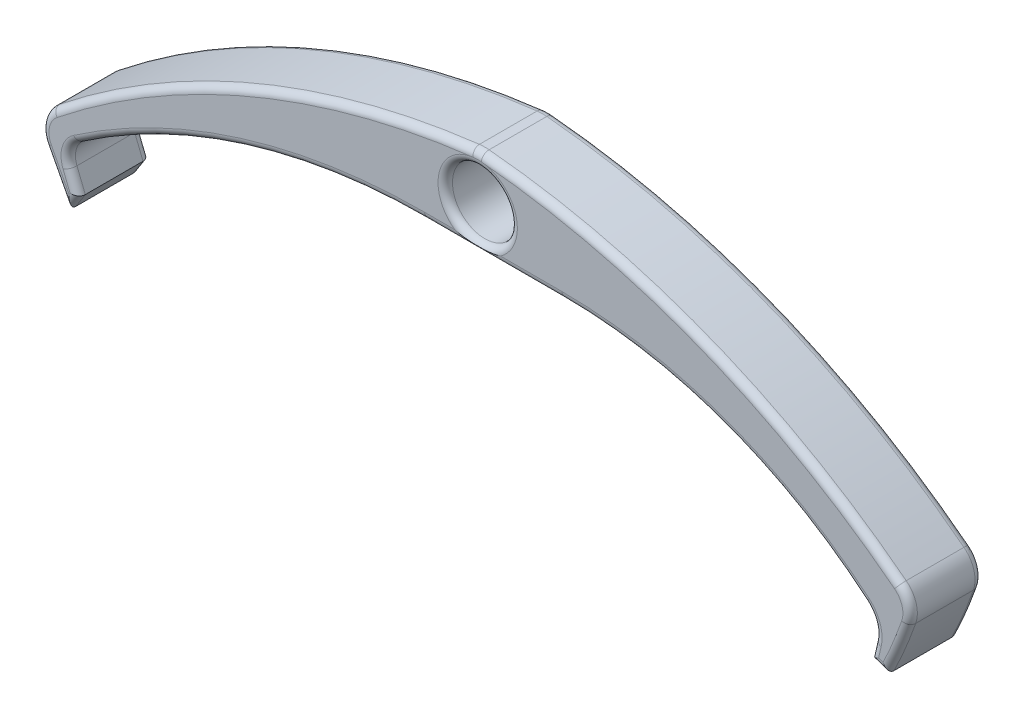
ISO-10303-21;
HEADER;
FILE_DESCRIPTION(('STEP AP214'),'2;1');
FILE_NAME('part.step','',(''),(''),'','','');
FILE_SCHEMA(('AUTOMOTIVE_DESIGN { 1 0 10303 214 1 1 1 1 }'));
ENDSEC;
DATA;
#1=APPLICATION_CONTEXT('core data for automotive mechanical design processes');
#2=APPLICATION_PROTOCOL_DEFINITION('international standard','automotive_design',2000,#1);
#3=PRODUCT_CONTEXT('',#1,'mechanical');
#4=PRODUCT('Part','Part','',(#3));
#5=PRODUCT_RELATED_PRODUCT_CATEGORY('part','',(#4));
#6=PRODUCT_DEFINITION_FORMATION('','',#4);
#7=PRODUCT_DEFINITION_CONTEXT('part definition',#1,'design');
#8=PRODUCT_DEFINITION('design','',#6,#7);
#9=PRODUCT_DEFINITION_SHAPE('','',#8);
#10=(LENGTH_UNIT() NAMED_UNIT(*) SI_UNIT(.MILLI.,.METRE.));
#11=(NAMED_UNIT(*) PLANE_ANGLE_UNIT() SI_UNIT($,.RADIAN.));
#12=(NAMED_UNIT(*) SI_UNIT($,.STERADIAN.) SOLID_ANGLE_UNIT());
#13=UNCERTAINTY_MEASURE_WITH_UNIT(LENGTH_MEASURE(1.E-05),#10,'distance_accuracy_value','');
#14=(GEOMETRIC_REPRESENTATION_CONTEXT(3) GLOBAL_UNCERTAINTY_ASSIGNED_CONTEXT((#13)) GLOBAL_UNIT_ASSIGNED_CONTEXT((#10,
#11,#12)) REPRESENTATION_CONTEXT('',''));
#15=CARTESIAN_POINT('',(0.,0.,0.));
#16=DIRECTION('',(0.,0.,1.));
#17=DIRECTION('',(1.,0.,0.));
#18=AXIS2_PLACEMENT_3D('',#15,#16,#17);
#19=CARTESIAN_POINT('',(12.733706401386,-107.750186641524,10.));
#20=DIRECTION('',(0.,0.,1.));
#21=DIRECTION('',(1.,0.,0.));
#22=AXIS2_PLACEMENT_3D('',#19,#20,#21);
#23=PLANE('',#22);
#24=CARTESIAN_POINT('',(-9.23678100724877,-103.087011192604,10.));
#25=DIRECTION('',(0.,0.,1.));
#26=DIRECTION('',(1.,0.,0.));
#27=AXIS2_PLACEMENT_3D('',#24,#25,#26);
#28=CIRCLE('',#27,109.);
#29=CARTESIAN_POINT('',(57.7940818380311,-17.1343298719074,10.));
#30=VERTEX_POINT('',#29);
#31=CARTESIAN_POINT('',(0.490843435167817,5.47805373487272,10.));
#32=VERTEX_POINT('',#31);
#33=EDGE_CURVE('E40',#30,#32,#28,.T.);
#34=ORIENTED_EDGE('',*,*,#33,.T.);
#35=CARTESIAN_POINT('',(0.,0.,10.));
#36=DIRECTION('',(0.,0.,1.));
#37=DIRECTION('',(1.,0.,0.));
#38=AXIS2_PLACEMENT_3D('',#35,#36,#37);
#39=CIRCLE('',#38,5.5);
#40=CARTESIAN_POINT('',(3.16227766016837,-4.5,10.));
#41=VERTEX_POINT('',#40);
#42=EDGE_CURVE('E11',#32,#41,#39,.F.);
#43=ORIENTED_EDGE('',*,*,#42,.T.);
#44=DIRECTION('',(1.,0.,0.));
#45=VECTOR('',#44,1.);
#46=CARTESIAN_POINT('',(11.6937218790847,-4.5,10.));
#47=LINE('',#46,#45);
#48=CARTESIAN_POINT('',(11.6937218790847,-4.5,10.));
#49=VERTEX_POINT('',#48);
#50=EDGE_CURVE('E406',#41,#49,#47,.T.);
#51=ORIENTED_EDGE('',*,*,#50,.T.);
#52=CARTESIAN_POINT('',(11.6937218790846,-70.5,10.));
#53=DIRECTION('',(0.,0.,1.));
#54=DIRECTION('',(1.,0.,0.));
#55=AXIS2_PLACEMENT_3D('',#52,#53,#54);
#56=CIRCLE('',#55,66.);
#57=CARTESIAN_POINT('',(54.2831180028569,-20.0803278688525,10.));
#58=VERTEX_POINT('',#57);
#59=EDGE_CURVE('E408',#49,#58,#56,.F.);
#60=ORIENTED_EDGE('',*,*,#59,.T.);
#61=CARTESIAN_POINT('',(51.0566485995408,-23.9,10.));
#62=DIRECTION('',(0.,0.,1.));
#63=DIRECTION('',(1.,0.,0.));
#64=AXIS2_PLACEMENT_3D('',#61,#62,#63);
#65=CIRCLE('',#64,5.00000000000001);
#66=CARTESIAN_POINT('',(55.928498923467,-25.0247552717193,10.));
#67=VERTEX_POINT('',#66);
#68=EDGE_CURVE('E410',#58,#67,#65,.F.);
#69=ORIENTED_EDGE('',*,*,#68,.T.);
#70=DIRECTION('',(-0.224951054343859,-0.974370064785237,0.));
#71=VECTOR('',#70,1.);
#72=CARTESIAN_POINT('',(55.3743700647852,-27.4249510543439,10.));
#73=LINE('',#72,#71);
#74=CARTESIAN_POINT('',(55.576683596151,-26.5486348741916,10.));
#75=VERTEX_POINT('',#74);
#76=EDGE_CURVE('E412',#67,#75,#73,.T.);
#77=ORIENTED_EDGE('',*,*,#76,.T.);
#78=DIRECTION('',(0.945144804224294,-0.326651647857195,0.));
#79=VECTOR('',#78,1.);
#80=CARTESIAN_POINT('',(57.0413984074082,-27.0548551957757,10.));
#81=LINE('',#80,#79);
#82=CARTESIAN_POINT('',(56.2023500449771,-26.7648715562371,10.));
#83=VERTEX_POINT('',#82);
#84=EDGE_CURVE('E414',#75,#83,#81,.T.);
#85=ORIENTED_EDGE('',*,*,#84,.T.);
#86=CARTESIAN_POINT('',(0.,0.,10.));
#87=DIRECTION('',(0.,0.,1.));
#88=DIRECTION('',(1.,0.,0.));
#89=AXIS2_PLACEMENT_3D('',#86,#87,#88);
#90=CIRCLE('',#89,62.25);
#91=CARTESIAN_POINT('',(58.7820663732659,-20.4873417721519,10.));
#92=VERTEX_POINT('',#91);
#93=EDGE_CURVE('E416',#83,#92,#90,.T.);
#94=ORIENTED_EDGE('',*,*,#93,.T.);
#95=CARTESIAN_POINT('',(55.9491957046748,-19.5,10.));
#96=DIRECTION('',(0.,0.,1.));
#97=DIRECTION('',(1.,0.,0.));
#98=AXIS2_PLACEMENT_3D('',#95,#96,#97);
#99=CIRCLE('',#98,3.00000000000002);
#100=EDGE_CURVE('E51',#92,#30,#99,.T.);
#101=ORIENTED_EDGE('',*,*,#100,.T.);
#102=EDGE_LOOP('',(#34,#43,#51,#60,#69,#77,#85,#94,#101));
#103=FACE_BOUND('',#102,.T.);
#104=ADVANCED_FACE('F31',(#103),#23,.T.);
#105=CARTESIAN_POINT('',(12.733706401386,-107.750186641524,0.));
#106=DIRECTION('',(0.,0.,1.));
#107=DIRECTION('',(1.,0.,0.));
#108=AXIS2_PLACEMENT_3D('',#105,#106,#107);
#109=PLANE('',#108);
#110=DIRECTION('',(1.,0.,0.));
#111=VECTOR('',#110,1.);
#112=CARTESIAN_POINT('',(12.733706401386,-4.5,0.));
#113=LINE('',#112,#111);
#114=CARTESIAN_POINT('',(11.6937218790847,-4.5,0.));
#115=VERTEX_POINT('',#114);
#116=CARTESIAN_POINT('',(3.16227766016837,-4.5,0.));
#117=VERTEX_POINT('',#116);
#118=EDGE_CURVE('E312',#115,#117,#113,.F.);
#119=ORIENTED_EDGE('',*,*,#118,.T.);
#120=CARTESIAN_POINT('',(0.,0.,0.));
#121=DIRECTION('',(0.,0.,1.));
#122=DIRECTION('',(1.,0.,0.));
#123=AXIS2_PLACEMENT_3D('',#120,#121,#122);
#124=CIRCLE('',#123,5.5);
#125=CARTESIAN_POINT('',(0.490843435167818,5.47805373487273,0.));
#126=VERTEX_POINT('',#125);
#127=EDGE_CURVE('E314',#117,#126,#124,.T.);
#128=ORIENTED_EDGE('',*,*,#127,.T.);
#129=CARTESIAN_POINT('',(-9.23678100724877,-103.087011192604,0.));
#130=DIRECTION('',(0.,0.,1.));
#131=DIRECTION('',(1.,0.,0.));
#132=AXIS2_PLACEMENT_3D('',#129,#130,#131);
#133=CIRCLE('',#132,109.);
#134=CARTESIAN_POINT('',(57.7940818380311,-17.1343298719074,0.));
#135=VERTEX_POINT('',#134);
#136=EDGE_CURVE('E298',#126,#135,#133,.F.);
#137=ORIENTED_EDGE('',*,*,#136,.T.);
#138=CARTESIAN_POINT('',(55.9491957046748,-19.5,0.));
#139=DIRECTION('',(0.,0.,1.));
#140=DIRECTION('',(1.,0.,0.));
#141=AXIS2_PLACEMENT_3D('',#138,#139,#140);
#142=CIRCLE('',#141,3.00000000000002);
#143=CARTESIAN_POINT('',(58.7820663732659,-20.4873417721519,0.));
#144=VERTEX_POINT('',#143);
#145=EDGE_CURVE('E300',#135,#144,#142,.F.);
#146=ORIENTED_EDGE('',*,*,#145,.T.);
#147=CARTESIAN_POINT('',(0.,0.,0.));
#148=DIRECTION('',(0.,0.,1.));
#149=DIRECTION('',(1.,0.,0.));
#150=AXIS2_PLACEMENT_3D('',#147,#148,#149);
#151=CIRCLE('',#150,62.25);
#152=CARTESIAN_POINT('',(56.2023500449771,-26.7648715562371,0.));
#153=VERTEX_POINT('',#152);
#154=EDGE_CURVE('E302',#144,#153,#151,.F.);
#155=ORIENTED_EDGE('',*,*,#154,.T.);
#156=DIRECTION('',(0.945144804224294,-0.326651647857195,0.));
#157=VECTOR('',#156,1.);
#158=CARTESIAN_POINT('',(42.3747151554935,-21.9859004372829,0.));
#159=LINE('',#158,#157);
#160=CARTESIAN_POINT('',(55.5766835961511,-26.5486348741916,0.));
#161=VERTEX_POINT('',#160);
#162=EDGE_CURVE('E304',#153,#161,#159,.F.);
#163=ORIENTED_EDGE('',*,*,#162,.T.);
#164=DIRECTION('',(-0.224951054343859,-0.974370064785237,0.));
#165=VECTOR('',#164,1.);
#166=CARTESIAN_POINT('',(35.6104927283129,-113.031708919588,0.));
#167=LINE('',#166,#165);
#168=CARTESIAN_POINT('',(55.928498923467,-25.0247552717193,0.));
#169=VERTEX_POINT('',#168);
#170=EDGE_CURVE('E306',#161,#169,#167,.F.);
#171=ORIENTED_EDGE('',*,*,#170,.T.);
#172=CARTESIAN_POINT('',(51.0566485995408,-23.9,0.));
#173=DIRECTION('',(0.,0.,1.));
#174=DIRECTION('',(1.,0.,0.));
#175=AXIS2_PLACEMENT_3D('',#172,#173,#174);
#176=CIRCLE('',#175,5.00000000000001);
#177=CARTESIAN_POINT('',(54.2831180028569,-20.0803278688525,0.));
#178=VERTEX_POINT('',#177);
#179=EDGE_CURVE('E308',#169,#178,#176,.T.);
#180=ORIENTED_EDGE('',*,*,#179,.T.);
#181=CARTESIAN_POINT('',(11.6937218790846,-70.5,0.));
#182=DIRECTION('',(0.,0.,1.));
#183=DIRECTION('',(1.,0.,0.));
#184=AXIS2_PLACEMENT_3D('',#181,#182,#183);
#185=CIRCLE('',#184,66.);
#186=EDGE_CURVE('E310',#178,#115,#185,.T.);
#187=ORIENTED_EDGE('',*,*,#186,.T.);
#188=EDGE_LOOP('',(#119,#128,#137,#146,#155,#163,#171,#180,#187));
#189=FACE_BOUND('',#188,.T.);
#190=ADVANCED_FACE('F823',(#189),#109,.F.);
#191=DIRECTION('',(1.,0.,0.));
#192=VECTOR('',#191,1.);
#193=CARTESIAN_POINT('',(11.6937218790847,-4.5,10.));
#194=LINE('',#193,#192);
#195=CARTESIAN_POINT('',(-7.35502771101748,-4.5,10.));
#196=VERTEX_POINT('',#195);
#197=CARTESIAN_POINT('',(-3.16227766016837,-4.5,10.));
#198=VERTEX_POINT('',#197);
#199=EDGE_CURVE('E401',#196,#198,#194,.T.);
#200=ORIENTED_EDGE('',*,*,#199,.T.);
#201=CARTESIAN_POINT('',(0.,0.,10.));
#202=DIRECTION('',(0.,0.,1.));
#203=DIRECTION('',(1.,0.,0.));
#204=AXIS2_PLACEMENT_3D('',#201,#202,#203);
#205=CIRCLE('',#204,5.5);
#206=CARTESIAN_POINT('',(-0.645487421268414,5.46199102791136,10.));
#207=VERTEX_POINT('',#206);
#208=EDGE_CURVE('E403',#198,#207,#205,.F.);
#209=ORIENTED_EDGE('',*,*,#208,.T.);
#210=CARTESIAN_POINT('',(12.733706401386,-107.750186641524,10.));
#211=DIRECTION('',(0.,0.,1.));
#212=DIRECTION('',(1.,0.,0.));
#213=AXIS2_PLACEMENT_3D('',#210,#211,#212);
#214=CIRCLE('',#213,114.);
#215=CARTESIAN_POINT('',(-58.3095596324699,-18.5938388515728,10.));
#216=VERTEX_POINT('',#215);
#217=EDGE_CURVE('E387',#207,#216,#214,.T.);
#218=ORIENTED_EDGE('',*,*,#217,.T.);
#219=CARTESIAN_POINT('',(-56.44,-20.9400585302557,10.));
#220=DIRECTION('',(0.,0.,1.));
#221=DIRECTION('',(1.,0.,0.));
#222=AXIS2_PLACEMENT_3D('',#219,#220,#221);
#223=CIRCLE('',#222,3.);
#224=CARTESIAN_POINT('',(-59.0986107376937,-22.3299466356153,10.));
#225=VERTEX_POINT('',#224);
#226=EDGE_CURVE('E389',#216,#225,#223,.T.);
#227=ORIENTED_EDGE('',*,*,#226,.T.);
#228=DIRECTION('',(0.463296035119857,-0.886203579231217,0.));
#229=VECTOR('',#228,1.);
#230=CARTESIAN_POINT('',(-55.8537964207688,-28.5367039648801,10.));
#231=LINE('',#230,#229);
#232=CARTESIAN_POINT('',(-56.6539611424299,-27.0061300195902,10.));
#233=VERTEX_POINT('',#232);
#234=EDGE_CURVE('E391',#225,#233,#231,.T.);
#235=ORIENTED_EDGE('',*,*,#234,.T.);
#236=DIRECTION('',(0.537914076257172,0.842999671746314,0.));
#237=VECTOR('',#236,1.);
#238=CARTESIAN_POINT('',(-56.2429996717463,-26.3620859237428,10.));
#239=LINE('',#238,#237);
#240=CARTESIAN_POINT('',(-56.5191044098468,-26.7947873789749,10.));
#241=VERTEX_POINT('',#240);
#242=EDGE_CURVE('E393',#233,#241,#239,.T.);
#243=ORIENTED_EDGE('',*,*,#242,.T.);
#244=DIRECTION('',(-0.371367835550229,0.928485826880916,0.));
#245=VECTOR('',#244,1.);
#246=CARTESIAN_POINT('',(-57.4827620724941,-24.3854713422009,10.));
#247=LINE('',#246,#245);
#248=CARTESIAN_POINT('',(-57.4827620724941,-24.3854713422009,10.));
#249=VERTEX_POINT('',#248);
#250=EDGE_CURVE('E395',#241,#249,#247,.T.);
#251=ORIENTED_EDGE('',*,*,#250,.T.);
#252=CARTESIAN_POINT('',(-53.7688187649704,-22.9,10.));
#253=DIRECTION('',(0.,0.,1.));
#254=DIRECTION('',(1.,0.,0.));
#255=AXIS2_PLACEMENT_3D('',#252,#253,#254);
#256=CIRCLE('',#255,4.);
#257=CARTESIAN_POINT('',(-56.0329061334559,-19.6024390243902,10.));
#258=VERTEX_POINT('',#257);
#259=EDGE_CURVE('E397',#249,#258,#256,.F.);
#260=ORIENTED_EDGE('',*,*,#259,.T.);
#261=CARTESIAN_POINT('',(-7.35502771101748,-90.5,10.));
#262=DIRECTION('',(0.,0.,1.));
#263=DIRECTION('',(1.,0.,0.));
#264=AXIS2_PLACEMENT_3D('',#261,#262,#263);
#265=CIRCLE('',#264,86.);
#266=EDGE_CURVE('E399',#258,#196,#265,.F.);
#267=ORIENTED_EDGE('',*,*,#266,.T.);
#268=EDGE_LOOP('',(#200,#209,#218,#227,#235,#243,#251,#260,#267));
#269=FACE_BOUND('',#268,.T.);
#270=ADVANCED_FACE('F819',(#269),#23,.T.);
#271=DIRECTION('',(0.537914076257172,0.842999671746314,0.));
#272=VECTOR('',#271,1.);
#273=CARTESIAN_POINT('',(-73.1908438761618,-52.9221402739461,0.));
#274=LINE('',#273,#272);
#275=CARTESIAN_POINT('',(-56.5191044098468,-26.7947873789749,0.));
#276=VERTEX_POINT('',#275);
#277=CARTESIAN_POINT('',(-56.6539611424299,-27.0061300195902,0.));
#278=VERTEX_POINT('',#277);
#279=EDGE_CURVE('E295',#276,#278,#274,.F.);
#280=ORIENTED_EDGE('',*,*,#279,.T.);
#281=DIRECTION('',(0.463296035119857,-0.886203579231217,0.));
#282=VECTOR('',#281,1.);
#283=CARTESIAN_POINT('',(-8.60890990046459,-118.907836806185,0.));
#284=LINE('',#283,#282);
#285=CARTESIAN_POINT('',(-59.0986107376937,-22.3299466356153,0.));
#286=VERTEX_POINT('',#285);
#287=EDGE_CURVE('E259',#278,#286,#284,.F.);
#288=ORIENTED_EDGE('',*,*,#287,.T.);
#289=CARTESIAN_POINT('',(-56.44,-20.9400585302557,0.));
#290=DIRECTION('',(0.,0.,1.));
#291=DIRECTION('',(1.,0.,0.));
#292=AXIS2_PLACEMENT_3D('',#289,#290,#291);
#293=CIRCLE('',#292,3.);
#294=CARTESIAN_POINT('',(-58.3095596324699,-18.5938388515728,0.));
#295=VERTEX_POINT('',#294);
#296=EDGE_CURVE('E251',#286,#295,#293,.F.);
#297=ORIENTED_EDGE('',*,*,#296,.T.);
#298=CARTESIAN_POINT('',(12.733706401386,-107.750186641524,0.));
#299=DIRECTION('',(0.,0.,1.));
#300=DIRECTION('',(1.,0.,0.));
#301=AXIS2_PLACEMENT_3D('',#298,#299,#300);
#302=CIRCLE('',#301,114.);
#303=CARTESIAN_POINT('',(-0.645487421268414,5.46199102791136,0.));
#304=VERTEX_POINT('',#303);
#305=EDGE_CURVE('E256',#295,#304,#302,.F.);
#306=ORIENTED_EDGE('',*,*,#305,.T.);
#307=CARTESIAN_POINT('',(0.,0.,0.));
#308=DIRECTION('',(0.,0.,1.));
#309=DIRECTION('',(1.,0.,0.));
#310=AXIS2_PLACEMENT_3D('',#307,#308,#309);
#311=CIRCLE('',#310,5.5);
#312=CARTESIAN_POINT('',(-3.16227766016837,-4.5,0.));
#313=VERTEX_POINT('',#312);
#314=EDGE_CURVE('E262',#304,#313,#311,.T.);
#315=ORIENTED_EDGE('',*,*,#314,.T.);
#316=DIRECTION('',(1.,0.,0.));
#317=VECTOR('',#316,1.);
#318=CARTESIAN_POINT('',(12.733706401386,-4.5,0.));
#319=LINE('',#318,#317);
#320=CARTESIAN_POINT('',(-7.35502771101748,-4.5,0.));
#321=VERTEX_POINT('',#320);
#322=EDGE_CURVE('E287',#313,#321,#319,.F.);
#323=ORIENTED_EDGE('',*,*,#322,.T.);
#324=CARTESIAN_POINT('',(-7.35502771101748,-90.5,0.));
#325=DIRECTION('',(0.,0.,1.));
#326=DIRECTION('',(1.,0.,0.));
#327=AXIS2_PLACEMENT_3D('',#324,#325,#326);
#328=CIRCLE('',#327,86.);
#329=CARTESIAN_POINT('',(-56.0329061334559,-19.6024390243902,0.));
#330=VERTEX_POINT('',#329);
#331=EDGE_CURVE('E289',#321,#330,#328,.T.);
#332=ORIENTED_EDGE('',*,*,#331,.T.);
#333=CARTESIAN_POINT('',(-53.7688187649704,-22.9,0.));
#334=DIRECTION('',(0.,0.,1.));
#335=DIRECTION('',(1.,0.,0.));
#336=AXIS2_PLACEMENT_3D('',#333,#334,#335);
#337=CIRCLE('',#336,4.);
#338=CARTESIAN_POINT('',(-57.4827620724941,-24.3854713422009,0.));
#339=VERTEX_POINT('',#338);
#340=EDGE_CURVE('E291',#330,#339,#337,.T.);
#341=ORIENTED_EDGE('',*,*,#340,.T.);
#342=DIRECTION('',(-0.371367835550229,0.928485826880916,0.));
#343=VECTOR('',#342,1.);
#344=CARTESIAN_POINT('',(-19.0539547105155,-120.464343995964,0.));
#345=LINE('',#344,#343);
#346=EDGE_CURVE('E293',#339,#276,#345,.F.);
#347=ORIENTED_EDGE('',*,*,#346,.T.);
#348=EDGE_LOOP('',(#280,#288,#297,#306,#315,#323,#332,#341,#347));
#349=FACE_BOUND('',#348,.T.);
#350=ADVANCED_FACE('F253',(#349),#109,.F.);
#351=CARTESIAN_POINT('',(12.733706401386,-107.750186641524,10.));
#352=DIRECTION('',(0.,0.,-1.));
#353=DIRECTION('',(-1.,0.,0.));
#354=AXIS2_PLACEMENT_3D('',#351,#352,#353);
#355=CYLINDRICAL_SURFACE('',#354,115.);
#356=DIRECTION('',(0.,0.,-1.));
#357=VECTOR('',#356,1.);
#358=CARTESIAN_POINT('',(-0.762848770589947,6.45508030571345,10.));
#359=LINE('',#358,#357);
#360=CARTESIAN_POINT('',(-0.762848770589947,6.45508030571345,9.));
#361=VERTEX_POINT('',#360);
#362=CARTESIAN_POINT('',(-0.762848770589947,6.45508030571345,0.999999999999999));
#363=VERTEX_POINT('',#362);
#364=EDGE_CURVE('E502',#361,#363,#359,.T.);
#365=ORIENTED_EDGE('',*,*,#364,.T.);
#366=CARTESIAN_POINT('',(12.733706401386,-107.750186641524,0.999999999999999));
#367=DIRECTION('',(0.,0.,1.));
#368=DIRECTION('',(1.,0.,0.));
#369=AXIS2_PLACEMENT_3D('',#366,#367,#368);
#370=CIRCLE('',#369,115.);
#371=CARTESIAN_POINT('',(-58.9327461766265,-17.8117656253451,0.999999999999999));
#372=VERTEX_POINT('',#371);
#373=EDGE_CURVE('E385',#363,#372,#370,.T.);
#374=ORIENTED_EDGE('',*,*,#373,.T.);
#375=DIRECTION('',(0.,0.,-1.));
#376=VECTOR('',#375,1.);
#377=CARTESIAN_POINT('',(-58.9327461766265,-17.8117656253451,10.));
#378=LINE('',#377,#376);
#379=CARTESIAN_POINT('',(-58.9327461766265,-17.8117656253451,9.));
#380=VERTEX_POINT('',#379);
#381=EDGE_CURVE('E279',#380,#372,#378,.T.);
#382=ORIENTED_EDGE('',*,*,#381,.F.);
#383=CARTESIAN_POINT('',(12.733706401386,-107.750186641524,9.));
#384=DIRECTION('',(0.,0.,1.));
#385=DIRECTION('',(1.,0.,0.));
#386=AXIS2_PLACEMENT_3D('',#383,#384,#385);
#387=CIRCLE('',#386,115.);
#388=EDGE_CURVE('E383',#380,#361,#387,.F.);
#389=ORIENTED_EDGE('',*,*,#388,.T.);
#390=EDGE_LOOP('',(#365,#374,#382,#389));
#391=FACE_BOUND('',#390,.T.);
#392=ADVANCED_FACE('F697',(#391),#355,.T.);
#393=CARTESIAN_POINT('',(-56.44,-20.9400585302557,10.));
#394=DIRECTION('',(0.,0.,-1.));
#395=DIRECTION('',(-1.,0.,0.));
#396=AXIS2_PLACEMENT_3D('',#393,#394,#395);
#397=CYLINDRICAL_SURFACE('',#396,4.);
#398=ORIENTED_EDGE('',*,*,#381,.T.);
#399=CARTESIAN_POINT('',(-56.44,-20.9400585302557,0.999999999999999));
#400=DIRECTION('',(0.,0.,1.));
#401=DIRECTION('',(1.,0.,0.));
#402=AXIS2_PLACEMENT_3D('',#399,#400,#401);
#403=CIRCLE('',#402,4.);
#404=CARTESIAN_POINT('',(-59.9848143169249,-22.7932426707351,0.999999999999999));
#405=VERTEX_POINT('',#404);
#406=EDGE_CURVE('E269',#372,#405,#403,.T.);
#407=ORIENTED_EDGE('',*,*,#406,.T.);
#408=DIRECTION('',(0.,0.,-1.));
#409=VECTOR('',#408,1.);
#410=CARTESIAN_POINT('',(-59.9848143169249,-22.7932426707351,10.));
#411=LINE('',#410,#409);
#412=CARTESIAN_POINT('',(-59.9848143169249,-22.7932426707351,9.));
#413=VERTEX_POINT('',#412);
#414=EDGE_CURVE('E282',#413,#405,#411,.T.);
#415=ORIENTED_EDGE('',*,*,#414,.F.);
#416=CARTESIAN_POINT('',(-56.44,-20.9400585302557,9.));
#417=DIRECTION('',(0.,0.,1.));
#418=DIRECTION('',(1.,0.,0.));
#419=AXIS2_PLACEMENT_3D('',#416,#417,#418);
#420=CIRCLE('',#419,4.);
#421=EDGE_CURVE('E323',#413,#380,#420,.F.);
#422=ORIENTED_EDGE('',*,*,#421,.T.);
#423=EDGE_LOOP('',(#398,#407,#415,#422));
#424=FACE_BOUND('',#423,.T.);
#425=ADVANCED_FACE('F659',(#424),#397,.T.);
#426=CARTESIAN_POINT('',(-56.74,-29.,10.));
#427=DIRECTION('',(0.886203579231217,0.463296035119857,0.));
#428=DIRECTION('',(-0.463296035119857,0.886203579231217,0.));
#429=AXIS2_PLACEMENT_3D('',#426,#427,#428);
#430=PLANE('',#429);
#431=ORIENTED_EDGE('',*,*,#414,.T.);
#432=DIRECTION('',(0.463296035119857,-0.886203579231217,0.));
#433=VECTOR('',#432,1.);
#434=CARTESIAN_POINT('',(-56.74,-29.,0.999999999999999));
#435=LINE('',#434,#433);
#436=CARTESIAN_POINT('',(-56.74,-29.,0.999999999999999));
#437=VERTEX_POINT('',#436);
#438=EDGE_CURVE('E328',#405,#437,#435,.T.);
#439=ORIENTED_EDGE('',*,*,#438,.T.);
#440=DIRECTION('',(0.,0.,-1.));
#441=VECTOR('',#440,1.);
#442=CARTESIAN_POINT('',(-56.74,-29.,10.));
#443=LINE('',#442,#441);
#444=CARTESIAN_POINT('',(-56.74,-29.,9.));
#445=VERTEX_POINT('',#444);
#446=EDGE_CURVE('E643',#445,#437,#443,.T.);
#447=ORIENTED_EDGE('',*,*,#446,.F.);
#448=DIRECTION('',(0.463296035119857,-0.886203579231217,0.));
#449=VECTOR('',#448,1.);
#450=CARTESIAN_POINT('',(-59.9848143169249,-22.7932426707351,9.));
#451=LINE('',#450,#449);
#452=EDGE_CURVE('E326',#445,#413,#451,.F.);
#453=ORIENTED_EDGE('',*,*,#452,.T.);
#454=EDGE_LOOP('',(#431,#439,#447,#453));
#455=FACE_BOUND('',#454,.T.);
#456=ADVANCED_FACE('F657',(#455),#430,.F.);
#457=CARTESIAN_POINT('',(-56.74,-29.,10.));
#458=DIRECTION('',(-0.842999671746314,0.537914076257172,0.));
#459=DIRECTION('',(-0.537914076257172,-0.842999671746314,0.));
#460=AXIS2_PLACEMENT_3D('',#457,#458,#459);
#461=PLANE('',#460);
#462=ORIENTED_EDGE('',*,*,#446,.T.);
#463=DIRECTION('',(0.537914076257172,0.842999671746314,0.));
#464=VECTOR('',#463,1.);
#465=CARTESIAN_POINT('',(-56.74,-29.,0.999999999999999));
#466=LINE('',#465,#464);
#467=CARTESIAN_POINT('',(-55.4,-26.9,0.999999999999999));
#468=VERTEX_POINT('',#467);
#469=EDGE_CURVE('E332',#437,#468,#466,.T.);
#470=ORIENTED_EDGE('',*,*,#469,.T.);
#471=DIRECTION('',(0.,0.,-1.));
#472=VECTOR('',#471,1.);
#473=CARTESIAN_POINT('',(-55.4,-26.9,10.));
#474=LINE('',#473,#472);
#475=CARTESIAN_POINT('',(-55.4,-26.9,9.));
#476=VERTEX_POINT('',#475);
#477=EDGE_CURVE('E633',#476,#468,#474,.T.);
#478=ORIENTED_EDGE('',*,*,#477,.F.);
#479=DIRECTION('',(0.537914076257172,0.842999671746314,0.));
#480=VECTOR('',#479,1.);
#481=CARTESIAN_POINT('',(-56.74,-29.,9.));
#482=LINE('',#481,#480);
#483=EDGE_CURVE('E330',#476,#445,#482,.F.);
#484=ORIENTED_EDGE('',*,*,#483,.T.);
#485=EDGE_LOOP('',(#462,#470,#478,#484));
#486=FACE_BOUND('',#485,.T.);
#487=ADVANCED_FACE('F640',(#486),#461,.F.);
#488=CARTESIAN_POINT('',(-55.4,-26.9,10.));
#489=DIRECTION('',(-0.928485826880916,-0.371367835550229,0.));
#490=DIRECTION('',(0.371367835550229,-0.928485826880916,0.));
#491=AXIS2_PLACEMENT_3D('',#488,#489,#490);
#492=PLANE('',#491);
#493=ORIENTED_EDGE('',*,*,#477,.T.);
#494=DIRECTION('',(-0.371367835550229,0.928485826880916,0.));
#495=VECTOR('',#494,1.);
#496=CARTESIAN_POINT('',(-55.4,-26.9,0.999999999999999));
#497=LINE('',#496,#495);
#498=CARTESIAN_POINT('',(-56.5542762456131,-24.0141035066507,0.999999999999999));
#499=VERTEX_POINT('',#498);
#500=EDGE_CURVE('E336',#468,#499,#497,.T.);
#501=ORIENTED_EDGE('',*,*,#500,.T.);
#502=DIRECTION('',(0.,0.,-1.));
#503=VECTOR('',#502,1.);
#504=CARTESIAN_POINT('',(-56.5542762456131,-24.0141035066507,10.));
#505=LINE('',#504,#503);
#506=CARTESIAN_POINT('',(-56.5542762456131,-24.0141035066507,9.));
#507=VERTEX_POINT('',#506);
#508=EDGE_CURVE('E636',#507,#499,#505,.T.);
#509=ORIENTED_EDGE('',*,*,#508,.F.);
#510=DIRECTION('',(-0.371367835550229,0.928485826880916,0.));
#511=VECTOR('',#510,1.);
#512=CARTESIAN_POINT('',(-55.4,-26.9,9.));
#513=LINE('',#512,#511);
#514=EDGE_CURVE('E334',#507,#476,#513,.F.);
#515=ORIENTED_EDGE('',*,*,#514,.T.);
#516=EDGE_LOOP('',(#493,#501,#509,#515));
#517=FACE_BOUND('',#516,.T.);
#518=ADVANCED_FACE('F632',(#517),#492,.F.);
#519=CARTESIAN_POINT('',(-53.7688187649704,-22.9,10.));
#520=DIRECTION('',(0.,0.,-1.));
#521=DIRECTION('',(-1.,0.,0.));
#522=AXIS2_PLACEMENT_3D('',#519,#520,#521);
#523=CYLINDRICAL_SURFACE('',#522,3.);
#524=ORIENTED_EDGE('',*,*,#508,.T.);
#525=CARTESIAN_POINT('',(-53.7688187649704,-22.9,0.999999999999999));
#526=DIRECTION('',(0.,0.,1.));
#527=DIRECTION('',(1.,0.,0.));
#528=AXIS2_PLACEMENT_3D('',#525,#526,#527);
#529=CIRCLE('',#528,3.);
#530=CARTESIAN_POINT('',(-55.4668842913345,-20.4268292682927,0.999999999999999));
#531=VERTEX_POINT('',#530);
#532=EDGE_CURVE('E340',#499,#531,#529,.F.);
#533=ORIENTED_EDGE('',*,*,#532,.T.);
#534=DIRECTION('',(0.,0.,-1.));
#535=VECTOR('',#534,1.);
#536=CARTESIAN_POINT('',(-55.4668842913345,-20.4268292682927,10.));
#537=LINE('',#536,#535);
#538=CARTESIAN_POINT('',(-55.4668842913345,-20.4268292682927,9.));
#539=VERTEX_POINT('',#538);
#540=EDGE_CURVE('E664',#539,#531,#537,.T.);
#541=ORIENTED_EDGE('',*,*,#540,.F.);
#542=CARTESIAN_POINT('',(-53.7688187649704,-22.9,9.));
#543=DIRECTION('',(0.,0.,1.));
#544=DIRECTION('',(1.,0.,0.));
#545=AXIS2_PLACEMENT_3D('',#542,#543,#544);
#546=CIRCLE('',#545,3.);
#547=EDGE_CURVE('E338',#539,#507,#546,.T.);
#548=ORIENTED_EDGE('',*,*,#547,.T.);
#549=EDGE_LOOP('',(#524,#533,#541,#548));
#550=FACE_BOUND('',#549,.T.);
#551=ADVANCED_FACE('F744',(#550),#523,.F.);
#552=CARTESIAN_POINT('',(-7.35502771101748,-90.5,10.));
#553=DIRECTION('',(0.,0.,-1.));
#554=DIRECTION('',(-1.,0.,0.));
#555=AXIS2_PLACEMENT_3D('',#552,#553,#554);
#556=CYLINDRICAL_SURFACE('',#555,85.);
#557=ORIENTED_EDGE('',*,*,#540,.T.);
#558=CARTESIAN_POINT('',(-7.35502771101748,-90.5,0.999999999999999));
#559=DIRECTION('',(0.,0.,1.));
#560=DIRECTION('',(1.,0.,0.));
#561=AXIS2_PLACEMENT_3D('',#558,#559,#560);
#562=CIRCLE('',#561,85.);
#563=CARTESIAN_POINT('',(-7.35502771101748,-5.50000000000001,0.999999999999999));
#564=VERTEX_POINT('',#563);
#565=EDGE_CURVE('E344',#531,#564,#562,.F.);
#566=ORIENTED_EDGE('',*,*,#565,.T.);
#567=DIRECTION('',(0.,0.,-1.));
#568=VECTOR('',#567,1.);
#569=CARTESIAN_POINT('',(-7.35502771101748,-5.50000000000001,10.));
#570=LINE('',#569,#568);
#571=CARTESIAN_POINT('',(-7.35502771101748,-5.50000000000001,9.));
#572=VERTEX_POINT('',#571);
#573=EDGE_CURVE('E667',#572,#564,#570,.T.);
#574=ORIENTED_EDGE('',*,*,#573,.F.);
#575=CARTESIAN_POINT('',(-7.35502771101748,-90.5,9.));
#576=DIRECTION('',(0.,0.,1.));
#577=DIRECTION('',(1.,0.,0.));
#578=AXIS2_PLACEMENT_3D('',#575,#576,#577);
#579=CIRCLE('',#578,85.);
#580=EDGE_CURVE('E342',#572,#539,#579,.T.);
#581=ORIENTED_EDGE('',*,*,#580,.T.);
#582=EDGE_LOOP('',(#557,#566,#574,#581));
#583=FACE_BOUND('',#582,.T.);
#584=ADVANCED_FACE('F748',(#583),#556,.F.);
#585=CARTESIAN_POINT('',(-7.35502771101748,-5.50000000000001,10.));
#586=DIRECTION('',(0.,1.,0.));
#587=DIRECTION('',(0.,0.,1.));
#588=AXIS2_PLACEMENT_3D('',#585,#586,#587);
#589=PLANE('',#588);
#590=ORIENTED_EDGE('',*,*,#573,.T.);
#591=DIRECTION('',(1.,0.,0.));
#592=VECTOR('',#591,1.);
#593=CARTESIAN_POINT('',(-7.35502771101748,-5.50000000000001,0.999999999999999));
#594=LINE('',#593,#592);
#595=CARTESIAN_POINT('',(11.6937218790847,-5.50000000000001,0.999999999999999));
#596=VERTEX_POINT('',#595);
#597=EDGE_CURVE('E348',#564,#596,#594,.T.);
#598=ORIENTED_EDGE('',*,*,#597,.T.);
#599=DIRECTION('',(0.,0.,-1.));
#600=VECTOR('',#599,1.);
#601=CARTESIAN_POINT('',(11.6937218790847,-5.50000000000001,10.));
#602=LINE('',#601,#600);
#603=CARTESIAN_POINT('',(11.6937218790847,-5.50000000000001,9.));
#604=VERTEX_POINT('',#603);
#605=EDGE_CURVE('E670',#604,#596,#602,.T.);
#606=ORIENTED_EDGE('',*,*,#605,.F.);
#607=DIRECTION('',(1.,0.,0.));
#608=VECTOR('',#607,1.);
#609=CARTESIAN_POINT('',(-7.35502771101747,-5.50000000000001,9.));
#610=LINE('',#609,#608);
#611=EDGE_CURVE('E346',#604,#572,#610,.F.);
#612=ORIENTED_EDGE('',*,*,#611,.T.);
#613=EDGE_LOOP('',(#590,#598,#606,#612));
#614=FACE_BOUND('',#613,.T.);
#615=ADVANCED_FACE('F760',(#614),#589,.F.);
#616=CARTESIAN_POINT('',(11.6937218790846,-70.5,10.));
#617=DIRECTION('',(0.,0.,-1.));
#618=DIRECTION('',(-1.,0.,0.));
#619=AXIS2_PLACEMENT_3D('',#616,#617,#618);
#620=CYLINDRICAL_SURFACE('',#619,65.);
#621=ORIENTED_EDGE('',*,*,#605,.T.);
#622=CARTESIAN_POINT('',(11.6937218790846,-70.5,0.999999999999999));
#623=DIRECTION('',(0.,0.,1.));
#624=DIRECTION('',(1.,0.,0.));
#625=AXIS2_PLACEMENT_3D('',#622,#623,#624);
#626=CIRCLE('',#625,65.);
#627=CARTESIAN_POINT('',(53.6378241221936,-20.844262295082,0.999999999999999));
#628=VERTEX_POINT('',#627);
#629=EDGE_CURVE('E352',#596,#628,#626,.F.);
#630=ORIENTED_EDGE('',*,*,#629,.T.);
#631=DIRECTION('',(0.,0.,-1.));
#632=VECTOR('',#631,1.);
#633=CARTESIAN_POINT('',(53.6378241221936,-20.844262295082,10.));
#634=LINE('',#633,#632);
#635=CARTESIAN_POINT('',(53.6378241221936,-20.844262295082,9.));
#636=VERTEX_POINT('',#635);
#637=EDGE_CURVE('E673',#636,#628,#634,.T.);
#638=ORIENTED_EDGE('',*,*,#637,.F.);
#639=CARTESIAN_POINT('',(11.6937218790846,-70.5,9.));
#640=DIRECTION('',(0.,0.,1.));
#641=DIRECTION('',(1.,0.,0.));
#642=AXIS2_PLACEMENT_3D('',#639,#640,#641);
#643=CIRCLE('',#642,65.);
#644=EDGE_CURVE('E350',#636,#604,#643,.T.);
#645=ORIENTED_EDGE('',*,*,#644,.T.);
#646=EDGE_LOOP('',(#621,#630,#638,#645));
#647=FACE_BOUND('',#646,.T.);
#648=ADVANCED_FACE('F763',(#647),#620,.F.);
#649=CARTESIAN_POINT('',(51.0566485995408,-23.9,10.));
#650=DIRECTION('',(0.,0.,-1.));
#651=DIRECTION('',(-1.,0.,0.));
#652=AXIS2_PLACEMENT_3D('',#649,#650,#651);
#653=CYLINDRICAL_SURFACE('',#652,4.00000000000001);
#654=ORIENTED_EDGE('',*,*,#637,.T.);
#655=CARTESIAN_POINT('',(51.0566485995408,-23.9,0.999999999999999));
#656=DIRECTION('',(0.,0.,1.));
#657=DIRECTION('',(1.,0.,0.));
#658=AXIS2_PLACEMENT_3D('',#655,#656,#657);
#659=CIRCLE('',#658,4.00000000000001);
#660=CARTESIAN_POINT('',(54.9541288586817,-24.7998042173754,0.999999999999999));
#661=VERTEX_POINT('',#660);
#662=EDGE_CURVE('E356',#628,#661,#659,.F.);
#663=ORIENTED_EDGE('',*,*,#662,.T.);
#664=DIRECTION('',(0.,0.,-1.));
#665=VECTOR('',#664,1.);
#666=CARTESIAN_POINT('',(54.9541288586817,-24.7998042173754,10.));
#667=LINE('',#666,#665);
#668=CARTESIAN_POINT('',(54.9541288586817,-24.7998042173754,9.));
#669=VERTEX_POINT('',#668);
#670=EDGE_CURVE('E676',#669,#661,#667,.T.);
#671=ORIENTED_EDGE('',*,*,#670,.F.);
#672=CARTESIAN_POINT('',(51.0566485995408,-23.9,9.));
#673=DIRECTION('',(0.,0.,1.));
#674=DIRECTION('',(1.,0.,0.));
#675=AXIS2_PLACEMENT_3D('',#672,#673,#674);
#676=CIRCLE('',#675,4.00000000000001);
#677=EDGE_CURVE('E354',#669,#636,#676,.T.);
#678=ORIENTED_EDGE('',*,*,#677,.T.);
#679=EDGE_LOOP('',(#654,#663,#671,#678));
#680=FACE_BOUND('',#679,.T.);
#681=ADVANCED_FACE('F772',(#680),#653,.F.);
#682=CARTESIAN_POINT('',(54.4,-27.2,10.));
#683=DIRECTION('',(0.974370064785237,-0.224951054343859,0.));
#684=DIRECTION('',(0.224951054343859,0.974370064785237,0.));
#685=AXIS2_PLACEMENT_3D('',#682,#683,#684);
#686=PLANE('',#685);
#687=ORIENTED_EDGE('',*,*,#670,.T.);
#688=DIRECTION('',(-0.224951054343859,-0.974370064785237,0.));
#689=VECTOR('',#688,1.);
#690=CARTESIAN_POINT('',(54.4,-27.2,0.999999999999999));
#691=LINE('',#690,#689);
#692=CARTESIAN_POINT('',(54.4,-27.2,0.999999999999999));
#693=VERTEX_POINT('',#692);
#694=EDGE_CURVE('E360',#661,#693,#691,.T.);
#695=ORIENTED_EDGE('',*,*,#694,.T.);
#696=DIRECTION('',(0.,0.,-1.));
#697=VECTOR('',#696,1.);
#698=CARTESIAN_POINT('',(54.4,-27.2,10.));
#699=LINE('',#698,#697);
#700=CARTESIAN_POINT('',(54.4,-27.2,9.));
#701=VERTEX_POINT('',#700);
#702=EDGE_CURVE('E679',#701,#693,#699,.T.);
#703=ORIENTED_EDGE('',*,*,#702,.F.);
#704=DIRECTION('',(-0.224951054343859,-0.974370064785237,0.));
#705=VECTOR('',#704,1.);
#706=CARTESIAN_POINT('',(54.9541288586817,-24.7998042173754,9.));
#707=LINE('',#706,#705);
#708=EDGE_CURVE('E358',#701,#669,#707,.F.);
#709=ORIENTED_EDGE('',*,*,#708,.T.);
#710=EDGE_LOOP('',(#687,#695,#703,#709));
#711=FACE_BOUND('',#710,.T.);
#712=ADVANCED_FACE('F775',(#711),#686,.F.);
#713=CARTESIAN_POINT('',(56.714746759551,-28.,10.));
#714=DIRECTION('',(0.326651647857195,0.945144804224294,0.));
#715=DIRECTION('',(-0.945144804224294,0.326651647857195,0.));
#716=AXIS2_PLACEMENT_3D('',#713,#714,#715);
#717=PLANE('',#716);
#718=ORIENTED_EDGE('',*,*,#702,.T.);
#719=DIRECTION('',(0.945144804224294,-0.326651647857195,0.));
#720=VECTOR('',#719,1.);
#721=CARTESIAN_POINT('',(56.714746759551,-28.,0.999999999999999));
#722=LINE('',#721,#720);
#723=CARTESIAN_POINT('',(56.714746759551,-28.,0.999999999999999));
#724=VERTEX_POINT('',#723);
#725=EDGE_CURVE('E364',#693,#724,#722,.T.);
#726=ORIENTED_EDGE('',*,*,#725,.T.);
#727=DIRECTION('',(0.,0.,-1.));
#728=VECTOR('',#727,1.);
#729=CARTESIAN_POINT('',(56.714746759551,-28.,10.));
#730=LINE('',#729,#728);
#731=CARTESIAN_POINT('',(56.714746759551,-28.,9.));
#732=VERTEX_POINT('',#731);
#733=EDGE_CURVE('E682',#732,#724,#730,.T.);
#734=ORIENTED_EDGE('',*,*,#733,.F.);
#735=DIRECTION('',(0.945144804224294,-0.326651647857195,0.));
#736=VECTOR('',#735,1.);
#737=CARTESIAN_POINT('',(54.4,-27.2,9.));
#738=LINE('',#737,#736);
#739=EDGE_CURVE('E362',#732,#701,#738,.F.);
#740=ORIENTED_EDGE('',*,*,#739,.T.);
#741=EDGE_LOOP('',(#718,#726,#734,#740));
#742=FACE_BOUND('',#741,.T.);
#743=ADVANCED_FACE('F787',(#742),#717,.F.);
#744=CARTESIAN_POINT('',(0.,0.,10.));
#745=DIRECTION('',(0.,0.,-1.));
#746=DIRECTION('',(-1.,0.,0.));
#747=AXIS2_PLACEMENT_3D('',#744,#745,#746);
#748=CYLINDRICAL_SURFACE('',#747,63.25);
#749=ORIENTED_EDGE('',*,*,#733,.T.);
#750=CARTESIAN_POINT('',(0.,0.,0.999999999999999));
#751=DIRECTION('',(0.,0.,1.));
#752=DIRECTION('',(1.,0.,0.));
#753=AXIS2_PLACEMENT_3D('',#750,#751,#752);
#754=CIRCLE('',#753,63.25);
#755=CARTESIAN_POINT('',(59.7263565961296,-20.8164556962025,0.999999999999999));
#756=VERTEX_POINT('',#755);
#757=EDGE_CURVE('E368',#724,#756,#754,.T.);
#758=ORIENTED_EDGE('',*,*,#757,.T.);
#759=DIRECTION('',(0.,0.,-1.));
#760=VECTOR('',#759,1.);
#761=CARTESIAN_POINT('',(59.7263565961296,-20.8164556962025,10.));
#762=LINE('',#761,#760);
#763=CARTESIAN_POINT('',(59.7263565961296,-20.8164556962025,9.));
#764=VERTEX_POINT('',#763);
#765=EDGE_CURVE('E685',#764,#756,#762,.T.);
#766=ORIENTED_EDGE('',*,*,#765,.F.);
#767=CARTESIAN_POINT('',(0.,0.,9.));
#768=DIRECTION('',(0.,0.,1.));
#769=DIRECTION('',(1.,0.,0.));
#770=AXIS2_PLACEMENT_3D('',#767,#768,#769);
#771=CIRCLE('',#770,63.25);
#772=EDGE_CURVE('E366',#764,#732,#771,.F.);
#773=ORIENTED_EDGE('',*,*,#772,.T.);
#774=EDGE_LOOP('',(#749,#758,#766,#773));
#775=FACE_BOUND('',#774,.T.);
#776=ADVANCED_FACE('F789',(#775),#748,.T.);
#777=CARTESIAN_POINT('',(55.9491957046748,-19.5,10.));
#778=DIRECTION('',(0.,0.,-1.));
#779=DIRECTION('',(-1.,0.,0.));
#780=AXIS2_PLACEMENT_3D('',#777,#778,#779);
#781=CYLINDRICAL_SURFACE('',#780,4.00000000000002);
#782=ORIENTED_EDGE('',*,*,#765,.T.);
#783=CARTESIAN_POINT('',(55.9491957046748,-19.5,0.999999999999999));
#784=DIRECTION('',(0.,0.,1.));
#785=DIRECTION('',(1.,0.,0.));
#786=AXIS2_PLACEMENT_3D('',#783,#784,#785);
#787=CIRCLE('',#786,4.00000000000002);
#788=CARTESIAN_POINT('',(58.4090438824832,-16.3457731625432,0.999999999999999));
#789=VERTEX_POINT('',#788);
#790=EDGE_CURVE('E372',#756,#789,#787,.T.);
#791=ORIENTED_EDGE('',*,*,#790,.T.);
#792=DIRECTION('',(0.,0.,-1.));
#793=VECTOR('',#792,1.);
#794=CARTESIAN_POINT('',(58.4090438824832,-16.3457731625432,10.));
#795=LINE('',#794,#793);
#796=CARTESIAN_POINT('',(58.4090438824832,-16.3457731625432,9.));
#797=VERTEX_POINT('',#796);
#798=EDGE_CURVE('E688',#797,#789,#795,.T.);
#799=ORIENTED_EDGE('',*,*,#798,.F.);
#800=CARTESIAN_POINT('',(55.9491957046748,-19.5,9.));
#801=DIRECTION('',(0.,0.,1.));
#802=DIRECTION('',(1.,0.,0.));
#803=AXIS2_PLACEMENT_3D('',#800,#801,#802);
#804=CIRCLE('',#803,4.00000000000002);
#805=EDGE_CURVE('E370',#797,#764,#804,.F.);
#806=ORIENTED_EDGE('',*,*,#805,.T.);
#807=EDGE_LOOP('',(#782,#791,#799,#806));
#808=FACE_BOUND('',#807,.T.);
#809=ADVANCED_FACE('F954',(#808),#781,.T.);
#810=CARTESIAN_POINT('',(-9.23678100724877,-103.087011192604,10.));
#811=DIRECTION('',(0.,0.,-1.));
#812=DIRECTION('',(-1.,0.,0.));
#813=AXIS2_PLACEMENT_3D('',#810,#811,#812);
#814=CYLINDRICAL_SURFACE('',#813,110.);
#815=ORIENTED_EDGE('',*,*,#798,.T.);
#816=CARTESIAN_POINT('',(-9.23678100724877,-103.087011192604,0.999999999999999));
#817=DIRECTION('',(0.,0.,1.));
#818=DIRECTION('',(1.,0.,0.));
#819=AXIS2_PLACEMENT_3D('',#816,#817,#818);
#820=CIRCLE('',#819,110.);
#821=CARTESIAN_POINT('',(0.58008769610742,6.47406350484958,0.999999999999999));
#822=VERTEX_POINT('',#821);
#823=EDGE_CURVE('E376',#789,#822,#820,.T.);
#824=ORIENTED_EDGE('',*,*,#823,.T.);
#825=DIRECTION('',(0.,0.,-1.));
#826=VECTOR('',#825,1.);
#827=CARTESIAN_POINT('',(0.58008769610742,6.47406350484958,10.));
#828=LINE('',#827,#826);
#829=CARTESIAN_POINT('',(0.58008769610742,6.47406350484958,9.));
#830=VERTEX_POINT('',#829);
#831=EDGE_CURVE('E691',#830,#822,#828,.T.);
#832=ORIENTED_EDGE('',*,*,#831,.F.);
#833=CARTESIAN_POINT('',(-9.23678100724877,-103.087011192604,9.));
#834=DIRECTION('',(0.,0.,1.));
#835=DIRECTION('',(1.,0.,0.));
#836=AXIS2_PLACEMENT_3D('',#833,#834,#835);
#837=CIRCLE('',#836,110.);
#838=EDGE_CURVE('E374',#830,#797,#837,.F.);
#839=ORIENTED_EDGE('',*,*,#838,.T.);
#840=EDGE_LOOP('',(#815,#824,#832,#839));
#841=FACE_BOUND('',#840,.T.);
#842=ADVANCED_FACE('F963',(#841),#814,.T.);
#843=CARTESIAN_POINT('',(0.,0.,10.));
#844=DIRECTION('',(0.,0.,-1.));
#845=DIRECTION('',(-1.,0.,0.));
#846=AXIS2_PLACEMENT_3D('',#843,#844,#845);
#847=CYLINDRICAL_SURFACE('',#846,6.50000000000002);
#848=ORIENTED_EDGE('',*,*,#831,.T.);
#849=CARTESIAN_POINT('',(0.,0.,0.999999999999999));
#850=DIRECTION('',(0.,0.,1.));
#851=DIRECTION('',(1.,0.,0.));
#852=AXIS2_PLACEMENT_3D('',#849,#850,#851);
#853=CIRCLE('',#852,6.50000000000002);
#854=EDGE_CURVE('E381',#822,#363,#853,.T.);
#855=ORIENTED_EDGE('',*,*,#854,.T.);
#856=ORIENTED_EDGE('',*,*,#364,.F.);
#857=CARTESIAN_POINT('',(0.,0.,9.));
#858=DIRECTION('',(0.,0.,1.));
#859=DIRECTION('',(1.,0.,0.));
#860=AXIS2_PLACEMENT_3D('',#857,#858,#859);
#861=CIRCLE('',#860,6.50000000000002);
#862=EDGE_CURVE('E378',#361,#830,#861,.F.);
#863=ORIENTED_EDGE('',*,*,#862,.T.);
#864=EDGE_LOOP('',(#848,#855,#856,#863));
#865=FACE_BOUND('',#864,.T.);
#866=ADVANCED_FACE('F973',(#865),#847,.T.);
#867=CARTESIAN_POINT('',(0.,0.,10.));
#868=DIRECTION('',(0.,0.,-1.));
#869=DIRECTION('',(-1.,0.,0.));
#870=AXIS2_PLACEMENT_3D('',#867,#868,#869);
#871=CYLINDRICAL_SURFACE('',#870,4.5);
#872=CARTESIAN_POINT('',(0.,0.,0.999999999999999));
#873=DIRECTION('',(0.,0.,1.));
#874=DIRECTION('',(1.,0.,0.));
#875=AXIS2_PLACEMENT_3D('',#872,#873,#874);
#876=CIRCLE('',#875,4.5);
#877=CARTESIAN_POINT('',(4.5,0.,0.999999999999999));
#878=VERTEX_POINT('',#877);
#879=EDGE_CURVE('E320',#878,#878,#876,.F.);
#880=ORIENTED_EDGE('',*,*,#879,.T.);
#881=EDGE_LOOP('',(#880));
#882=FACE_BOUND('',#881,.T.);
#883=CARTESIAN_POINT('',(0.,0.,9.));
#884=DIRECTION('',(0.,0.,1.));
#885=DIRECTION('',(1.,0.,0.));
#886=AXIS2_PLACEMENT_3D('',#883,#884,#885);
#887=CIRCLE('',#886,4.5);
#888=CARTESIAN_POINT('',(4.5,0.,9.));
#889=VERTEX_POINT('',#888);
#890=EDGE_CURVE('E317',#889,#889,#887,.T.);
#891=ORIENTED_EDGE('',*,*,#890,.T.);
#892=EDGE_LOOP('',(#891));
#893=FACE_BOUND('',#892,.T.);
#894=ADVANCED_FACE('F983',(#882,#893),#871,.F.);
#895=CARTESIAN_POINT('',(57.0413984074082,-27.0548551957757,0.999999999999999));
#896=DIRECTION('',(0.945144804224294,-0.326651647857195,0.));
#897=DIRECTION('',(0.326651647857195,0.945144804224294,0.));
#898=AXIS2_PLACEMENT_3D('',#895,#896,#897);
#899=CYLINDRICAL_SURFACE('',#898,1.);
#900=CARTESIAN_POINT('',(56.714746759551,-28.,0.999999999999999));
#901=CARTESIAN_POINT('',(56.7147480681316,-28.0000032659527,0.976789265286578));
#902=CARTESIAN_POINT('',(56.7143371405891,-27.9990026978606,0.953592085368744));
#903=CARTESIAN_POINT('',(56.7127070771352,-27.9950341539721,0.907409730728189));
#904=CARTESIAN_POINT('',(56.711488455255,-27.9920674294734,0.884424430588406));
#905=CARTESIAN_POINT('',(56.7066710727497,-27.9803407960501,0.816392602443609));
#906=CARTESIAN_POINT('',(56.7019101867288,-27.9687529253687,0.771884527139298));
#907=CARTESIAN_POINT('',(56.6896141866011,-27.9388382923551,0.685775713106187));
#908=CARTESIAN_POINT('',(56.6820850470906,-27.9205260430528,0.64416894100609));
#909=CARTESIAN_POINT('',(56.6646615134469,-27.878173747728,0.564458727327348));
#910=CARTESIAN_POINT('',(56.6547626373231,-27.8541228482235,0.526362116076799));
#911=CARTESIAN_POINT('',(56.629238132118,-27.7921507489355,0.441576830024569));
#912=CARTESIAN_POINT('',(56.6128192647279,-27.7523175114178,0.396525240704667));
#913=CARTESIAN_POINT('',(56.5773843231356,-27.6664470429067,0.314005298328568));
#914=CARTESIAN_POINT('',(56.5583638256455,-27.6203992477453,0.276550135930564));
#915=CARTESIAN_POINT('',(56.5121615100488,-27.5086840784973,0.198481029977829));
#916=CARTESIAN_POINT('',(56.4842956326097,-27.4414042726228,0.160585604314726));
#917=CARTESIAN_POINT('',(56.426518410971,-27.3021526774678,0.0970427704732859));
#918=CARTESIAN_POINT('',(56.3966052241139,-27.2301766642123,0.0714065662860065));
#919=CARTESIAN_POINT('',(56.339799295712,-27.0937418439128,0.0345032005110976));
#920=CARTESIAN_POINT('',(56.3130577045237,-27.029612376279,0.0217436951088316));
#921=CARTESIAN_POINT('',(56.2591492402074,-26.9005396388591,0.00463014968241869));
#922=CARTESIAN_POINT('',(56.2319833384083,-26.8355982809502,0.000259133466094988));
#923=CARTESIAN_POINT('',(56.203984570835,-26.7687724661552,3.72976236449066E-06));
#924=CARTESIAN_POINT('',(56.2031673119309,-26.7668219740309,2.03886737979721E-09));
#925=CARTESIAN_POINT('',(56.2023500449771,-26.7648715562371,0.));
#926=B_SPLINE_CURVE_WITH_KNOTS('',3,(#900,#901,#902,#903,#904,#905,#906,#907,#908,#909,#910,
#911,#912,#913,#914,#915,#916,#917,#918,#919,#920,#921,#922,#923,#924,#925),.UNSPECIFIED.,.F.,
.F.,(4,2,2,2,2,2,2,2,2,2,2,2,4),(0.,0.069581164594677,0.139118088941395,0.277052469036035,
0.414690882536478,0.552591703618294,0.738585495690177,0.924899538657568,1.16987556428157,
1.41507505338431,1.62651653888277,1.83752966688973,1.84387402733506),.UNSPECIFIED.);
#927=EDGE_CURVE('E487',#724,#153,#926,.T.);
#928=ORIENTED_EDGE('',*,*,#927,.F.);
#929=ORIENTED_EDGE('',*,*,#725,.F.);
#930=CARTESIAN_POINT('',(55.5766835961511,-26.5486348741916,0.999999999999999));
#931=DIRECTION('',(0.484308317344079,-0.874897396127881,0.));
#932=DIRECTION('',(0.874897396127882,0.484308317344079,0.));
#933=AXIS2_PLACEMENT_3D('',#930,#931,#932);
#934=ELLIPSE('',#933,1.34493896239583,1.);
#935=EDGE_CURVE('E494',#161,#693,#934,.F.);
#936=ORIENTED_EDGE('',*,*,#935,.F.);
#937=ORIENTED_EDGE('',*,*,#162,.F.);
#938=EDGE_LOOP('',(#928,#929,#936,#937));
#939=FACE_BOUND('',#938,.T.);
#940=ADVANCED_FACE('F483',(#939),#899,.T.);
#941=CARTESIAN_POINT('',(-57.5829996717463,-28.4620859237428,0.999999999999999));
#942=DIRECTION('',(0.537914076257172,0.842999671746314,0.));
#943=DIRECTION('',(-0.842999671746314,0.537914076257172,0.));
#944=AXIS2_PLACEMENT_3D('',#941,#942,#943);
#945=CYLINDRICAL_SURFACE('',#944,1.);
#946=CARTESIAN_POINT('',(-56.6539611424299,-27.0061300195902,0.999999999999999));
#947=DIRECTION('',(0.999070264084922,-0.0431115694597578,0.));
#948=DIRECTION('',(0.0431115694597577,0.999070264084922,0.));
#949=AXIS2_PLACEMENT_3D('',#946,#947,#948);
#950=ELLIPSE('',#949,1.99572547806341,1.);
#951=EDGE_CURVE('E495',#278,#437,#950,.F.);
#952=ORIENTED_EDGE('',*,*,#951,.F.);
#953=ORIENTED_EDGE('',*,*,#279,.F.);
#954=CARTESIAN_POINT('',(-56.5191044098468,-26.7947873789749,0.999999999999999));
#955=DIRECTION('',(0.0936022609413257,0.995609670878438,0.));
#956=DIRECTION('',(-0.995609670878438,0.0936022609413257,0.));
#957=AXIS2_PLACEMENT_3D('',#954,#955,#956);
#958=ELLIPSE('',#957,1.12403931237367,1.);
#959=EDGE_CURVE('E499',#468,#276,#958,.T.);
#960=ORIENTED_EDGE('',*,*,#959,.F.);
#961=ORIENTED_EDGE('',*,*,#469,.F.);
#962=EDGE_LOOP('',(#952,#953,#960,#961));
#963=FACE_BOUND('',#962,.T.);
#964=ADVANCED_FACE('F738',(#963),#945,.T.);
#965=CARTESIAN_POINT('',(-56.3284858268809,-27.2713678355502,0.999999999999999));
#966=DIRECTION('',(-0.371367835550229,0.928485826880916,0.));
#967=DIRECTION('',(-0.928485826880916,-0.371367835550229,0.));
#968=AXIS2_PLACEMENT_3D('',#965,#966,#967);
#969=CYLINDRICAL_SURFACE('',#968,1.);
#970=ORIENTED_EDGE('',*,*,#959,.T.);
#971=ORIENTED_EDGE('',*,*,#346,.F.);
#972=CARTESIAN_POINT('',(-57.4827620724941,-24.3854713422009,0.999999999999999));
#973=DIRECTION('',(-0.37136783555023,0.928485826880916,0.));
#974=DIRECTION('',(-0.928485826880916,-0.37136783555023,0.));
#975=AXIS2_PLACEMENT_3D('',#972,#973,#974);
#976=CIRCLE('',#975,1.);
#977=EDGE_CURVE('E728',#499,#339,#976,.T.);
#978=ORIENTED_EDGE('',*,*,#977,.F.);
#979=ORIENTED_EDGE('',*,*,#500,.F.);
#980=EDGE_LOOP('',(#970,#971,#978,#979));
#981=FACE_BOUND('',#980,.T.);
#982=ADVANCED_FACE('F742',(#981),#969,.T.);
#983=CARTESIAN_POINT('',(55.3743700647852,-27.4249510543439,0.999999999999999));
#984=DIRECTION('',(-0.224951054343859,-0.974370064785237,0.));
#985=DIRECTION('',(0.974370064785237,-0.224951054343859,0.));
#986=AXIS2_PLACEMENT_3D('',#983,#984,#985);
#987=CYLINDRICAL_SURFACE('',#986,1.);
#988=ORIENTED_EDGE('',*,*,#935,.T.);
#989=ORIENTED_EDGE('',*,*,#694,.F.);
#990=CARTESIAN_POINT('',(55.928498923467,-25.0247552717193,1.));
#991=DIRECTION('',(0.224951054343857,0.974370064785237,0.));
#992=DIRECTION('',(-0.974370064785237,0.224951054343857,0.));
#993=AXIS2_PLACEMENT_3D('',#990,#991,#992);
#994=CIRCLE('',#993,1.);
#995=EDGE_CURVE('E726',#169,#661,#994,.T.);
#996=ORIENTED_EDGE('',*,*,#995,.F.);
#997=ORIENTED_EDGE('',*,*,#170,.F.);
#998=EDGE_LOOP('',(#988,#989,#996,#997));
#999=FACE_BOUND('',#998,.T.);
#1000=ADVANCED_FACE('F481',(#999),#987,.T.);
#1001=CARTESIAN_POINT('',(0.,0.,0.999999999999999));
#1002=DIRECTION('',(0.,0.,1.));
#1003=DIRECTION('',(1.,0.,0.));
#1004=AXIS2_PLACEMENT_3D('',#1001,#1002,#1003);
#1005=TOROIDAL_SURFACE('',#1004,62.25,1.);
#1006=ORIENTED_EDGE('',*,*,#927,.T.);
#1007=ORIENTED_EDGE('',*,*,#154,.F.);
#1008=CARTESIAN_POINT('',(58.7820663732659,-20.4873417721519,0.999999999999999));
#1009=DIRECTION('',(0.329113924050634,0.944290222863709,0.));
#1010=DIRECTION('',(-0.944290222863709,0.329113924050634,0.));
#1011=AXIS2_PLACEMENT_3D('',#1008,#1009,#1010);
#1012=CIRCLE('',#1011,1.);
#1013=EDGE_CURVE('E723',#756,#144,#1012,.T.);
#1014=ORIENTED_EDGE('',*,*,#1013,.F.);
#1015=ORIENTED_EDGE('',*,*,#757,.F.);
#1016=EDGE_LOOP('',(#1006,#1007,#1014,#1015));
#1017=FACE_BOUND('',#1016,.T.);
#1018=ADVANCED_FACE('F476',(#1017),#1005,.T.);
#1019=CARTESIAN_POINT('',(-55.8537964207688,-28.5367039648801,0.999999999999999));
#1020=DIRECTION('',(0.463296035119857,-0.886203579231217,0.));
#1021=DIRECTION('',(0.886203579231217,0.463296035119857,0.));
#1022=AXIS2_PLACEMENT_3D('',#1019,#1020,#1021);
#1023=CYLINDRICAL_SURFACE('',#1022,1.);
#1024=ORIENTED_EDGE('',*,*,#951,.T.);
#1025=ORIENTED_EDGE('',*,*,#438,.F.);
#1026=CARTESIAN_POINT('',(-59.0986107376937,-22.3299466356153,1.));
#1027=DIRECTION('',(-0.463296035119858,0.886203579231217,0.));
#1028=DIRECTION('',(-0.886203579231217,-0.463296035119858,0.));
#1029=AXIS2_PLACEMENT_3D('',#1026,#1027,#1028);
#1030=CIRCLE('',#1029,1.);
#1031=EDGE_CURVE('E721',#286,#405,#1030,.T.);
#1032=ORIENTED_EDGE('',*,*,#1031,.F.);
#1033=ORIENTED_EDGE('',*,*,#287,.F.);
#1034=EDGE_LOOP('',(#1024,#1025,#1032,#1033));
#1035=FACE_BOUND('',#1034,.T.);
#1036=ADVANCED_FACE('F472',(#1035),#1023,.T.);
#1037=CARTESIAN_POINT('',(-53.7688187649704,-22.9,0.999999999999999));
#1038=DIRECTION('',(0.,0.,1.));
#1039=DIRECTION('',(1.,0.,0.));
#1040=AXIS2_PLACEMENT_3D('',#1037,#1038,#1039);
#1041=TOROIDAL_SURFACE('',#1040,4.,1.);
#1042=ORIENTED_EDGE('',*,*,#977,.T.);
#1043=ORIENTED_EDGE('',*,*,#340,.F.);
#1044=CARTESIAN_POINT('',(-56.0329061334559,-19.6024390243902,0.999999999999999));
#1045=DIRECTION('',(0.824390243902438,0.566021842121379,0.));
#1046=DIRECTION('',(-0.566021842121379,0.824390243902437,0.));
#1047=AXIS2_PLACEMENT_3D('',#1044,#1045,#1046);
#1048=CIRCLE('',#1047,1.);
#1049=EDGE_CURVE('E718',#531,#330,#1048,.T.);
#1050=ORIENTED_EDGE('',*,*,#1049,.F.);
#1051=ORIENTED_EDGE('',*,*,#532,.F.);
#1052=EDGE_LOOP('',(#1042,#1043,#1050,#1051));
#1053=FACE_BOUND('',#1052,.T.);
#1054=ADVANCED_FACE('F468',(#1053),#1041,.T.);
#1055=CARTESIAN_POINT('',(51.0566485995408,-23.9,0.999999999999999));
#1056=DIRECTION('',(0.,0.,1.));
#1057=DIRECTION('',(1.,0.,0.));
#1058=AXIS2_PLACEMENT_3D('',#1055,#1056,#1057);
#1059=TOROIDAL_SURFACE('',#1058,5.00000000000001,1.);
#1060=ORIENTED_EDGE('',*,*,#995,.T.);
#1061=ORIENTED_EDGE('',*,*,#662,.F.);
#1062=CARTESIAN_POINT('',(54.2831180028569,-20.0803278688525,1.));
#1063=DIRECTION('',(-0.76393442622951,0.645293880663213,0.));
#1064=DIRECTION('',(-0.645293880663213,-0.76393442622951,0.));
#1065=AXIS2_PLACEMENT_3D('',#1062,#1063,#1064);
#1066=CIRCLE('',#1065,1.);
#1067=EDGE_CURVE('E715',#178,#628,#1066,.T.);
#1068=ORIENTED_EDGE('',*,*,#1067,.F.);
#1069=ORIENTED_EDGE('',*,*,#179,.F.);
#1070=EDGE_LOOP('',(#1060,#1061,#1068,#1069));
#1071=FACE_BOUND('',#1070,.T.);
#1072=ADVANCED_FACE('F464',(#1071),#1059,.T.);
#1073=CARTESIAN_POINT('',(55.9491957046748,-19.5,0.999999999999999));
#1074=DIRECTION('',(0.,0.,1.));
#1075=DIRECTION('',(1.,0.,0.));
#1076=AXIS2_PLACEMENT_3D('',#1073,#1074,#1075);
#1077=TOROIDAL_SURFACE('',#1076,3.00000000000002,1.);
#1078=ORIENTED_EDGE('',*,*,#1013,.T.);
#1079=ORIENTED_EDGE('',*,*,#145,.F.);
#1080=CARTESIAN_POINT('',(57.7940818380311,-17.1343298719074,0.999999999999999));
#1081=DIRECTION('',(-0.78855670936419,0.614962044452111,0.));
#1082=DIRECTION('',(-0.614962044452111,-0.78855670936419,0.));
#1083=AXIS2_PLACEMENT_3D('',#1080,#1081,#1082);
#1084=CIRCLE('',#1083,1.);
#1085=EDGE_CURVE('E272',#789,#135,#1084,.T.);
#1086=ORIENTED_EDGE('',*,*,#1085,.F.);
#1087=ORIENTED_EDGE('',*,*,#790,.F.);
#1088=EDGE_LOOP('',(#1078,#1079,#1086,#1087));
#1089=FACE_BOUND('',#1088,.T.);
#1090=ADVANCED_FACE('F461',(#1089),#1077,.T.);
#1091=CARTESIAN_POINT('',(-56.44,-20.9400585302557,0.999999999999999));
#1092=DIRECTION('',(0.,0.,1.));
#1093=DIRECTION('',(1.,0.,0.));
#1094=AXIS2_PLACEMENT_3D('',#1091,#1092,#1093);
#1095=TOROIDAL_SURFACE('',#1094,3.,1.);
#1096=ORIENTED_EDGE('',*,*,#1031,.T.);
#1097=ORIENTED_EDGE('',*,*,#406,.F.);
#1098=CARTESIAN_POINT('',(-58.3095596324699,-18.5938388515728,1.));
#1099=DIRECTION('',(0.782073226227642,0.623186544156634,0.));
#1100=DIRECTION('',(-0.623186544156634,0.782073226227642,0.));
#1101=AXIS2_PLACEMENT_3D('',#1098,#1099,#1100);
#1102=CIRCLE('',#1101,1.);
#1103=EDGE_CURVE('E266',#295,#372,#1102,.T.);
#1104=ORIENTED_EDGE('',*,*,#1103,.F.);
#1105=ORIENTED_EDGE('',*,*,#296,.F.);
#1106=EDGE_LOOP('',(#1096,#1097,#1104,#1105));
#1107=FACE_BOUND('',#1106,.T.);
#1108=ADVANCED_FACE('F267',(#1107),#1095,.T.);
#1109=CARTESIAN_POINT('',(-7.35502771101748,-90.5,0.999999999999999));
#1110=DIRECTION('',(0.,0.,1.));
#1111=DIRECTION('',(1.,0.,0.));
#1112=AXIS2_PLACEMENT_3D('',#1109,#1110,#1111);
#1113=TOROIDAL_SURFACE('',#1112,86.,1.);
#1114=ORIENTED_EDGE('',*,*,#1049,.T.);
#1115=ORIENTED_EDGE('',*,*,#331,.F.);
#1116=CARTESIAN_POINT('',(-7.35502771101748,-4.5,0.999999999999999));
#1117=DIRECTION('',(1.,0.,0.));
#1118=DIRECTION('',(0.,0.,-1.));
#1119=AXIS2_PLACEMENT_3D('',#1116,#1117,#1118);
#1120=CIRCLE('',#1119,1.);
#1121=EDGE_CURVE('E273',#564,#321,#1120,.T.);
#1122=ORIENTED_EDGE('',*,*,#1121,.F.);
#1123=ORIENTED_EDGE('',*,*,#565,.F.);
#1124=EDGE_LOOP('',(#1114,#1115,#1122,#1123));
#1125=FACE_BOUND('',#1124,.T.);
#1126=ADVANCED_FACE('F454',(#1125),#1113,.T.);
#1127=CARTESIAN_POINT('',(11.6937218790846,-70.5,0.999999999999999));
#1128=DIRECTION('',(0.,0.,1.));
#1129=DIRECTION('',(1.,0.,0.));
#1130=AXIS2_PLACEMENT_3D('',#1127,#1128,#1129);
#1131=TOROIDAL_SURFACE('',#1130,66.,1.);
#1132=ORIENTED_EDGE('',*,*,#1067,.T.);
#1133=ORIENTED_EDGE('',*,*,#629,.F.);
#1134=CARTESIAN_POINT('',(11.6937218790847,-4.5,1.));
#1135=DIRECTION('',(-1.,0.,0.));
#1136=DIRECTION('',(0.,0.,1.));
#1137=AXIS2_PLACEMENT_3D('',#1134,#1135,#1136);
#1138=CIRCLE('',#1137,1.);
#1139=EDGE_CURVE('E705',#115,#596,#1138,.T.);
#1140=ORIENTED_EDGE('',*,*,#1139,.F.);
#1141=ORIENTED_EDGE('',*,*,#186,.F.);
#1142=EDGE_LOOP('',(#1132,#1133,#1140,#1141));
#1143=FACE_BOUND('',#1142,.T.);
#1144=ADVANCED_FACE('F450',(#1143),#1131,.T.);
#1145=CARTESIAN_POINT('',(-9.23678100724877,-103.087011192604,0.999999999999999));
#1146=DIRECTION('',(0.,0.,1.));
#1147=DIRECTION('',(1.,0.,0.));
#1148=AXIS2_PLACEMENT_3D('',#1145,#1146,#1147);
#1149=TOROIDAL_SURFACE('',#1148,109.,1.);
#1150=ORIENTED_EDGE('',*,*,#1085,.T.);
#1151=ORIENTED_EDGE('',*,*,#136,.F.);
#1152=CARTESIAN_POINT('',(0.490843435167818,5.47805373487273,0.999999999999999));
#1153=DIRECTION('',(-0.996009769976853,0.0892442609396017,0.));
#1154=DIRECTION('',(-0.0892442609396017,-0.996009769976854,0.));
#1155=AXIS2_PLACEMENT_3D('',#1152,#1153,#1154);
#1156=CIRCLE('',#1155,1.);
#1157=EDGE_CURVE('E704',#822,#126,#1156,.T.);
#1158=ORIENTED_EDGE('',*,*,#1157,.F.);
#1159=ORIENTED_EDGE('',*,*,#823,.F.);
#1160=EDGE_LOOP('',(#1150,#1151,#1158,#1159));
#1161=FACE_BOUND('',#1160,.T.);
#1162=ADVANCED_FACE('F447',(#1161),#1149,.T.);
#1163=CARTESIAN_POINT('',(12.733706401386,-107.750186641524,0.999999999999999));
#1164=DIRECTION('',(0.,0.,1.));
#1165=DIRECTION('',(1.,0.,0.));
#1166=AXIS2_PLACEMENT_3D('',#1163,#1164,#1165);
#1167=TOROIDAL_SURFACE('',#1166,114.,1.);
#1168=ORIENTED_EDGE('',*,*,#1103,.T.);
#1169=ORIENTED_EDGE('',*,*,#373,.F.);
#1170=CARTESIAN_POINT('',(-0.645487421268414,5.46199102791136,1.));
#1171=DIRECTION('',(0.993089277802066,0.11736134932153,0.));
#1172=DIRECTION('',(-0.11736134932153,0.993089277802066,0.));
#1173=AXIS2_PLACEMENT_3D('',#1170,#1171,#1172);
#1174=CIRCLE('',#1173,1.);
#1175=EDGE_CURVE('E277',#304,#363,#1174,.T.);
#1176=ORIENTED_EDGE('',*,*,#1175,.F.);
#1177=ORIENTED_EDGE('',*,*,#305,.F.);
#1178=EDGE_LOOP('',(#1168,#1169,#1176,#1177));
#1179=FACE_BOUND('',#1178,.T.);
#1180=ADVANCED_FACE('F275',(#1179),#1167,.T.);
#1181=CARTESIAN_POINT('',(-7.35502771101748,-4.5,0.999999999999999));
#1182=DIRECTION('',(1.,0.,0.));
#1183=DIRECTION('',(0.,0.,-1.));
#1184=AXIS2_PLACEMENT_3D('',#1181,#1182,#1183);
#1185=CYLINDRICAL_SURFACE('',#1184,1.);
#1186=ORIENTED_EDGE('',*,*,#1121,.T.);
#1187=ORIENTED_EDGE('',*,*,#322,.F.);
#1188=CARTESIAN_POINT('',(3.16227766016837,-4.5,0.));
#1189=CARTESIAN_POINT('',(3.15962676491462,-4.50083828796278,6.20750188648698E-09));
#1190=CARTESIAN_POINT('',(3.156975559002,-4.50167561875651,1.06008142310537E-06));
#1191=CARTESIAN_POINT('',(2.99445688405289,-4.55293919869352,0.000129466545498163));
#1192=CARTESIAN_POINT('',(2.83346458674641,-4.5998833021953,0.004040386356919));
#1193=CARTESIAN_POINT('',(2.50966727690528,-4.68639024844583,0.0165537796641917));
#1194=CARTESIAN_POINT('',(2.34686155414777,-4.7259500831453,0.025158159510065));
#1195=CARTESIAN_POINT('',(2.0194590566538,-4.79743102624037,0.0445381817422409));
#1196=CARTESIAN_POINT('',(1.85486000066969,-4.82934081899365,0.0553169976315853));
#1197=CARTESIAN_POINT('',(1.5242856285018,-4.88519355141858,0.0766785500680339));
#1198=CARTESIAN_POINT('',(1.35831022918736,-4.90913600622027,0.0872612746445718));
#1199=CARTESIAN_POINT('',(1.06618012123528,-4.94395197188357,0.10379682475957));
#1200=CARTESIAN_POINT('',(0.94026284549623,-4.95659120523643,0.110248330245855));
#1201=CARTESIAN_POINT('',(0.68794427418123,-4.97713233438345,0.121091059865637));
#1202=CARTESIAN_POINT('',(0.561542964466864,-4.98503409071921,0.125482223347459));
#1203=CARTESIAN_POINT('',(0.308469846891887,-4.99604285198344,0.131678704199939));
#1204=CARTESIAN_POINT('',(0.181798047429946,-4.99915000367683,0.133484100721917));
#1205=CARTESIAN_POINT('',(-0.071579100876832,-5.00054629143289,0.134289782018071));
#1206=CARTESIAN_POINT('',(-0.198284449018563,-4.9988355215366,0.133290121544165));
#1207=CARTESIAN_POINT('',(-0.451499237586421,-4.99060900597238,0.128607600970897));
#1208=CARTESIAN_POINT('',(-0.578008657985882,-4.98409279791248,0.124924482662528));
#1209=CARTESIAN_POINT('',(-0.830608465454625,-4.96630214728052,0.115317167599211));
#1210=CARTESIAN_POINT('',(-0.956698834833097,-4.95502750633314,0.109392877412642));
#1211=CARTESIAN_POINT('',(-1.20828121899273,-4.9277940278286,0.0959968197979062));
#1212=CARTESIAN_POINT('',(-1.33377325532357,-4.91183536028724,0.0885251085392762));
#1213=CARTESIAN_POINT('',(-1.58404429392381,-4.87532315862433,0.0728935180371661));
#1214=CARTESIAN_POINT('',(-1.70882328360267,-4.85476954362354,0.0647336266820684));
#1215=CARTESIAN_POINT('',(-1.944862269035,-4.81149903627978,0.0495059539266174));
#1216=CARTESIAN_POINT('',(-2.05620073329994,-4.78921784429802,0.0424117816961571));
#1217=CARTESIAN_POINT('',(-2.27814948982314,-4.74111735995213,0.0291835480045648));
#1218=CARTESIAN_POINT('',(-2.38875991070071,-4.71529871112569,0.0230493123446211));
#1219=CARTESIAN_POINT('',(-2.60905076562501,-4.6602485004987,0.0125260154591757));
#1220=CARTESIAN_POINT('',(-2.71873226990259,-4.63102168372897,0.00813456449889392));
#1221=CARTESIAN_POINT('',(-2.93722161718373,-4.56923295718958,0.00191617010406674));
#1222=CARTESIAN_POINT('',(-3.04602958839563,-4.53667154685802,8.88432293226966E-05));
#1223=CARTESIAN_POINT('',(-3.1569755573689,-4.50167561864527,1.05704053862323E-06));
#1224=CARTESIAN_POINT('',(-3.15962676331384,-4.50083828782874,3.10479878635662E-09));
#1225=CARTESIAN_POINT('',(-3.16227766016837,-4.5,0.));
#1226=B_SPLINE_CURVE_WITH_KNOTS('',3,(#1188,#1189,#1190,#1191,#1192,#1193,#1194,#1195,#1196,
#1197,#1198,#1199,#1200,#1201,#1202,#1203,#1204,#1205,#1206,#1207,#1208,#1209,#1210,#1211,#1212,
#1213,#1214,#1215,#1216,#1217,#1218,#1219,#1220,#1221,#1222,#1223,#1224,#1225),.UNSPECIFIED.,
.F.,.F.,(4,2,2,2,2,2,2,2,2,2,2,2,2,2,2,2,2,2,4),(0.,0.00834087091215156,0.511234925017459,
1.01433339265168,1.51817149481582,2.02204025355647,2.40208803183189,2.78214699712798,
3.16219432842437,3.54223424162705,3.92231072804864,4.30240306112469,4.68248159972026,
5.06256682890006,5.40381127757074,5.74499372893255,6.0857067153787,6.4263687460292,
6.43470961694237),.UNSPECIFIED.);
#1227=EDGE_CURVE('E422',#117,#313,#1226,.T.);
#1228=ORIENTED_EDGE('',*,*,#1227,.F.);
#1229=ORIENTED_EDGE('',*,*,#118,.F.);
#1230=ORIENTED_EDGE('',*,*,#1139,.T.);
#1231=ORIENTED_EDGE('',*,*,#597,.F.);
#1232=EDGE_LOOP('',(#1186,#1187,#1228,#1229,#1230,#1231));
#1233=FACE_BOUND('',#1232,.T.);
#1234=ADVANCED_FACE('F432',(#1233),#1185,.T.);
#1235=CARTESIAN_POINT('',(0.,0.,0.999999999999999));
#1236=DIRECTION('',(0.,0.,1.));
#1237=DIRECTION('',(1.,0.,0.));
#1238=AXIS2_PLACEMENT_3D('',#1235,#1236,#1237);
#1239=TOROIDAL_SURFACE('',#1238,5.50000000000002,1.);
#1240=ORIENTED_EDGE('',*,*,#854,.F.);
#1241=ORIENTED_EDGE('',*,*,#1157,.T.);
#1242=CARTESIAN_POINT('',(0.,0.,0.));
#1243=DIRECTION('',(0.,0.,1.));
#1244=DIRECTION('',(1.,0.,0.));
#1245=AXIS2_PLACEMENT_3D('',#1242,#1243,#1244);
#1246=CIRCLE('',#1245,5.50000000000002);
#1247=EDGE_CURVE('E420',#304,#126,#1246,.F.);
#1248=ORIENTED_EDGE('',*,*,#1247,.F.);
#1249=ORIENTED_EDGE('',*,*,#1175,.T.);
#1250=EDGE_LOOP('',(#1240,#1241,#1248,#1249));
#1251=FACE_BOUND('',#1250,.T.);
#1252=ADVANCED_FACE('F436',(#1251),#1239,.T.);
#1253=CARTESIAN_POINT('',(0.,0.,0.999999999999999));
#1254=DIRECTION('',(0.,0.,1.));
#1255=DIRECTION('',(1.,0.,0.));
#1256=AXIS2_PLACEMENT_3D('',#1253,#1254,#1255);
#1257=TOROIDAL_SURFACE('',#1256,5.5,1.);
#1258=ORIENTED_EDGE('',*,*,#879,.F.);
#1259=EDGE_LOOP('',(#1258));
#1260=FACE_BOUND('',#1259,.T.);
#1261=ORIENTED_EDGE('',*,*,#127,.F.);
#1262=ORIENTED_EDGE('',*,*,#1227,.T.);
#1263=ORIENTED_EDGE('',*,*,#314,.F.);
#1264=ORIENTED_EDGE('',*,*,#1247,.T.);
#1265=EDGE_LOOP('',(#1261,#1262,#1263,#1264));
#1266=FACE_BOUND('',#1265,.T.);
#1267=ADVANCED_FACE('F438',(#1260,#1266),#1257,.T.);
#1268=CARTESIAN_POINT('',(-73.1908438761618,-52.9221402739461,9.));
#1269=DIRECTION('',(-0.537914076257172,-0.842999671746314,0.));
#1270=DIRECTION('',(0.842999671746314,-0.537914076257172,0.));
#1271=AXIS2_PLACEMENT_3D('',#1268,#1269,#1270);
#1272=CYLINDRICAL_SURFACE('',#1271,1.);
#1273=CARTESIAN_POINT('',(-56.6539611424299,-27.0061300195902,9.));
#1274=DIRECTION('',(-0.999070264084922,0.0431115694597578,0.));
#1275=DIRECTION('',(0.0431115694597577,0.999070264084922,0.));
#1276=AXIS2_PLACEMENT_3D('',#1273,#1274,#1275);
#1277=ELLIPSE('',#1276,1.99572547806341,1.);
#1278=EDGE_CURVE('E578',#445,#233,#1277,.T.);
#1279=ORIENTED_EDGE('',*,*,#1278,.F.);
#1280=ORIENTED_EDGE('',*,*,#483,.F.);
#1281=CARTESIAN_POINT('',(-56.5191044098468,-26.7947873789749,9.));
#1282=DIRECTION('',(-0.0936022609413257,-0.995609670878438,0.));
#1283=DIRECTION('',(-0.995609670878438,0.0936022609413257,0.));
#1284=AXIS2_PLACEMENT_3D('',#1281,#1282,#1283);
#1285=ELLIPSE('',#1284,1.12403931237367,1.);
#1286=EDGE_CURVE('E582',#241,#476,#1285,.F.);
#1287=ORIENTED_EDGE('',*,*,#1286,.F.);
#1288=ORIENTED_EDGE('',*,*,#242,.F.);
#1289=EDGE_LOOP('',(#1279,#1280,#1287,#1288));
#1290=FACE_BOUND('',#1289,.T.);
#1291=ADVANCED_FACE('F33',(#1290),#1272,.T.);
#1292=CARTESIAN_POINT('',(42.3747151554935,-21.9859004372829,9.));
#1293=DIRECTION('',(-0.945144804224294,0.326651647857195,0.));
#1294=DIRECTION('',(-0.326651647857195,-0.945144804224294,0.));
#1295=AXIS2_PLACEMENT_3D('',#1292,#1293,#1294);
#1296=CYLINDRICAL_SURFACE('',#1295,1.);
#1297=CARTESIAN_POINT('',(56.714746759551,-28.,9.));
#1298=CARTESIAN_POINT('',(56.7147480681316,-28.0000032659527,9.02321073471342));
#1299=CARTESIAN_POINT('',(56.7143371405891,-27.9990026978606,9.04640791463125));
#1300=CARTESIAN_POINT('',(56.7127070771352,-27.9950341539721,9.09259026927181));
#1301=CARTESIAN_POINT('',(56.711488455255,-27.9920674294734,9.11557556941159));
#1302=CARTESIAN_POINT('',(56.7066710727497,-27.9803407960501,9.18360739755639));
#1303=CARTESIAN_POINT('',(56.7019101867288,-27.9687529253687,9.2281154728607));
#1304=CARTESIAN_POINT('',(56.6896141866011,-27.9388382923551,9.31422428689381));
#1305=CARTESIAN_POINT('',(56.6820850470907,-27.9205260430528,9.35583105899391));
#1306=CARTESIAN_POINT('',(56.6646615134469,-27.878173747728,9.43554127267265));
#1307=CARTESIAN_POINT('',(56.6547626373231,-27.8541228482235,9.4736378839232));
#1308=CARTESIAN_POINT('',(56.629238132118,-27.7921507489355,9.55842316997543));
#1309=CARTESIAN_POINT('',(56.6128192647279,-27.7523175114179,9.60347475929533));
#1310=CARTESIAN_POINT('',(56.5773843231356,-27.6664470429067,9.68599470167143));
#1311=CARTESIAN_POINT('',(56.5583638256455,-27.6203992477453,9.72344986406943));
#1312=CARTESIAN_POINT('',(56.5121615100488,-27.5086840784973,9.80151897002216));
#1313=CARTESIAN_POINT('',(56.4842956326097,-27.4414042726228,9.83941439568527));
#1314=CARTESIAN_POINT('',(56.426518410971,-27.3021526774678,9.90295722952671));
#1315=CARTESIAN_POINT('',(56.3966052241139,-27.2301766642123,9.92859343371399));
#1316=CARTESIAN_POINT('',(56.3397992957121,-27.0937418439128,9.9654967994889));
#1317=CARTESIAN_POINT('',(56.3130577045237,-27.029612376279,9.97825630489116));
#1318=CARTESIAN_POINT('',(56.2591492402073,-26.9005396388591,9.99536985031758));
#1319=CARTESIAN_POINT('',(56.231983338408,-26.8355982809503,9.99974086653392));
#1320=CARTESIAN_POINT('',(56.203984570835,-26.7687724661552,9.99999627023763));
#1321=CARTESIAN_POINT('',(56.2031673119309,-26.7668219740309,9.99999999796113));
#1322=CARTESIAN_POINT('',(56.2023500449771,-26.7648715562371,10.));
#1323=B_SPLINE_CURVE_WITH_KNOTS('',3,(#1297,#1298,#1299,#1300,#1301,#1302,#1303,#1304,#1305,
#1306,#1307,#1308,#1309,#1310,#1311,#1312,#1313,#1314,#1315,#1316,#1317,#1318,#1319,#1320,#1321,
#1322),.UNSPECIFIED.,.F.,.F.,(4,2,2,2,2,2,2,2,2,2,2,2,4),(0.,0.0695811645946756,
0.139118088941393,0.277052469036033,0.414690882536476,0.552591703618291,0.738585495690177,
0.924899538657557,1.16987556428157,1.41507505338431,1.62651653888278,1.83752966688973,
1.84387402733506),.UNSPECIFIED.);
#1324=EDGE_CURVE('E571',#83,#732,#1323,.F.);
#1325=ORIENTED_EDGE('',*,*,#1324,.F.);
#1326=ORIENTED_EDGE('',*,*,#84,.F.);
#1327=CARTESIAN_POINT('',(55.576683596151,-26.5486348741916,9.));
#1328=DIRECTION('',(-0.484308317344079,0.874897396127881,0.));
#1329=DIRECTION('',(0.874897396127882,0.484308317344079,0.));
#1330=AXIS2_PLACEMENT_3D('',#1327,#1328,#1329);
#1331=ELLIPSE('',#1330,1.34493896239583,1.);
#1332=EDGE_CURVE('E35',#701,#75,#1331,.T.);
#1333=ORIENTED_EDGE('',*,*,#1332,.F.);
#1334=ORIENTED_EDGE('',*,*,#739,.F.);
#1335=EDGE_LOOP('',(#1325,#1326,#1333,#1334));
#1336=FACE_BOUND('',#1335,.T.);
#1337=ADVANCED_FACE('F562',(#1336),#1296,.T.);
#1338=CARTESIAN_POINT('',(35.6104927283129,-113.031708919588,9.));
#1339=DIRECTION('',(0.224951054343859,0.974370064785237,0.));
#1340=DIRECTION('',(-0.974370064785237,0.224951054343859,0.));
#1341=AXIS2_PLACEMENT_3D('',#1338,#1339,#1340);
#1342=CYLINDRICAL_SURFACE('',#1341,1.);
#1343=ORIENTED_EDGE('',*,*,#1332,.T.);
#1344=ORIENTED_EDGE('',*,*,#76,.F.);
#1345=CARTESIAN_POINT('',(55.928498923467,-25.0247552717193,9.));
#1346=DIRECTION('',(0.224951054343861,0.974370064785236,0.));
#1347=DIRECTION('',(-0.974370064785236,0.224951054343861,0.));
#1348=AXIS2_PLACEMENT_3D('',#1345,#1346,#1347);
#1349=CIRCLE('',#1348,1.);
#1350=EDGE_CURVE('E579',#669,#67,#1349,.T.);
#1351=ORIENTED_EDGE('',*,*,#1350,.F.);
#1352=ORIENTED_EDGE('',*,*,#708,.F.);
#1353=EDGE_LOOP('',(#1343,#1344,#1351,#1352));
#1354=FACE_BOUND('',#1353,.T.);
#1355=ADVANCED_FACE('F566',(#1354),#1342,.T.);
#1356=CARTESIAN_POINT('',(-19.0539547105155,-120.464343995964,9.));
#1357=DIRECTION('',(0.371367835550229,-0.928485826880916,0.));
#1358=DIRECTION('',(0.928485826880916,0.371367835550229,0.));
#1359=AXIS2_PLACEMENT_3D('',#1356,#1357,#1358);
#1360=CYLINDRICAL_SURFACE('',#1359,1.);
#1361=ORIENTED_EDGE('',*,*,#1286,.T.);
#1362=ORIENTED_EDGE('',*,*,#514,.F.);
#1363=CARTESIAN_POINT('',(-57.4827620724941,-24.3854713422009,9.));
#1364=DIRECTION('',(-0.371367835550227,0.928485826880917,0.));
#1365=DIRECTION('',(-0.928485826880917,-0.371367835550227,0.));
#1366=AXIS2_PLACEMENT_3D('',#1363,#1364,#1365);
#1367=CIRCLE('',#1366,1.);
#1368=EDGE_CURVE('E621',#249,#507,#1367,.T.);
#1369=ORIENTED_EDGE('',*,*,#1368,.F.);
#1370=ORIENTED_EDGE('',*,*,#250,.F.);
#1371=EDGE_LOOP('',(#1361,#1362,#1369,#1370));
#1372=FACE_BOUND('',#1371,.T.);
#1373=ADVANCED_FACE('F627',(#1372),#1360,.T.);
#1374=CARTESIAN_POINT('',(-8.60890990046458,-118.907836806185,9.));
#1375=DIRECTION('',(-0.463296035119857,0.886203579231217,0.));
#1376=DIRECTION('',(-0.886203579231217,-0.463296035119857,0.));
#1377=AXIS2_PLACEMENT_3D('',#1374,#1375,#1376);
#1378=CYLINDRICAL_SURFACE('',#1377,1.);
#1379=ORIENTED_EDGE('',*,*,#1278,.T.);
#1380=ORIENTED_EDGE('',*,*,#234,.F.);
#1381=CARTESIAN_POINT('',(-59.0986107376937,-22.3299466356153,9.));
#1382=DIRECTION('',(-0.463296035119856,0.886203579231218,0.));
#1383=DIRECTION('',(-0.886203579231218,-0.463296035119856,0.));
#1384=AXIS2_PLACEMENT_3D('',#1381,#1382,#1383);
#1385=CIRCLE('',#1384,1.);
#1386=EDGE_CURVE('E613',#413,#225,#1385,.T.);
#1387=ORIENTED_EDGE('',*,*,#1386,.F.);
#1388=ORIENTED_EDGE('',*,*,#452,.F.);
#1389=EDGE_LOOP('',(#1379,#1380,#1387,#1388));
#1390=FACE_BOUND('',#1389,.T.);
#1391=ADVANCED_FACE('F652',(#1390),#1378,.T.);
#1392=CARTESIAN_POINT('',(0.,0.,9.));
#1393=DIRECTION('',(0.,0.,1.));
#1394=DIRECTION('',(1.,0.,0.));
#1395=AXIS2_PLACEMENT_3D('',#1392,#1393,#1394);
#1396=TOROIDAL_SURFACE('',#1395,62.25,1.);
#1397=ORIENTED_EDGE('',*,*,#1324,.T.);
#1398=ORIENTED_EDGE('',*,*,#772,.F.);
#1399=CARTESIAN_POINT('',(58.7820663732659,-20.4873417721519,9.));
#1400=DIRECTION('',(0.329113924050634,0.944290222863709,0.));
#1401=DIRECTION('',(-0.944290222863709,0.329113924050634,0.));
#1402=AXIS2_PLACEMENT_3D('',#1399,#1400,#1401);
#1403=CIRCLE('',#1402,1.);
#1404=EDGE_CURVE('E609',#92,#764,#1403,.T.);
#1405=ORIENTED_EDGE('',*,*,#1404,.F.);
#1406=ORIENTED_EDGE('',*,*,#93,.F.);
#1407=EDGE_LOOP('',(#1397,#1398,#1405,#1406));
#1408=FACE_BOUND('',#1407,.T.);
#1409=ADVANCED_FACE('F560',(#1408),#1396,.T.);
#1410=CARTESIAN_POINT('',(51.0566485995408,-23.9,9.));
#1411=DIRECTION('',(0.,0.,1.));
#1412=DIRECTION('',(1.,0.,0.));
#1413=AXIS2_PLACEMENT_3D('',#1410,#1411,#1412);
#1414=TOROIDAL_SURFACE('',#1413,5.00000000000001,1.);
#1415=ORIENTED_EDGE('',*,*,#1350,.T.);
#1416=ORIENTED_EDGE('',*,*,#68,.F.);
#1417=CARTESIAN_POINT('',(54.2831180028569,-20.0803278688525,9.));
#1418=DIRECTION('',(-0.763934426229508,0.645293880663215,0.));
#1419=DIRECTION('',(-0.645293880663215,-0.763934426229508,0.));
#1420=AXIS2_PLACEMENT_3D('',#1417,#1418,#1419);
#1421=CIRCLE('',#1420,1.);
#1422=EDGE_CURVE('E605',#636,#58,#1421,.T.);
#1423=ORIENTED_EDGE('',*,*,#1422,.F.);
#1424=ORIENTED_EDGE('',*,*,#677,.F.);
#1425=EDGE_LOOP('',(#1415,#1416,#1423,#1424));
#1426=FACE_BOUND('',#1425,.T.);
#1427=ADVANCED_FACE('F556',(#1426),#1414,.T.);
#1428=CARTESIAN_POINT('',(-53.7688187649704,-22.9,9.));
#1429=DIRECTION('',(0.,0.,1.));
#1430=DIRECTION('',(1.,0.,0.));
#1431=AXIS2_PLACEMENT_3D('',#1428,#1429,#1430);
#1432=TOROIDAL_SURFACE('',#1431,4.,1.);
#1433=ORIENTED_EDGE('',*,*,#1368,.T.);
#1434=ORIENTED_EDGE('',*,*,#547,.F.);
#1435=CARTESIAN_POINT('',(-56.0329061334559,-19.6024390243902,9.));
#1436=DIRECTION('',(0.824390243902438,0.566021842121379,0.));
#1437=DIRECTION('',(-0.566021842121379,0.824390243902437,0.));
#1438=AXIS2_PLACEMENT_3D('',#1435,#1436,#1437);
#1439=CIRCLE('',#1438,1.);
#1440=EDGE_CURVE('E610',#258,#539,#1439,.T.);
#1441=ORIENTED_EDGE('',*,*,#1440,.F.);
#1442=ORIENTED_EDGE('',*,*,#259,.F.);
#1443=EDGE_LOOP('',(#1433,#1434,#1441,#1442));
#1444=FACE_BOUND('',#1443,.T.);
#1445=ADVANCED_FACE('F552',(#1444),#1432,.T.);
#1446=CARTESIAN_POINT('',(-56.44,-20.9400585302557,9.));
#1447=DIRECTION('',(0.,0.,1.));
#1448=DIRECTION('',(1.,0.,0.));
#1449=AXIS2_PLACEMENT_3D('',#1446,#1447,#1448);
#1450=TOROIDAL_SURFACE('',#1449,3.,1.);
#1451=ORIENTED_EDGE('',*,*,#1386,.T.);
#1452=ORIENTED_EDGE('',*,*,#226,.F.);
#1453=CARTESIAN_POINT('',(-58.3095596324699,-18.5938388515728,9.));
#1454=DIRECTION('',(0.782073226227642,0.623186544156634,0.));
#1455=DIRECTION('',(-0.623186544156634,0.782073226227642,0.));
#1456=AXIS2_PLACEMENT_3D('',#1453,#1454,#1455);
#1457=CIRCLE('',#1456,1.);
#1458=EDGE_CURVE('E616',#380,#216,#1457,.T.);
#1459=ORIENTED_EDGE('',*,*,#1458,.F.);
#1460=ORIENTED_EDGE('',*,*,#421,.F.);
#1461=EDGE_LOOP('',(#1451,#1452,#1459,#1460));
#1462=FACE_BOUND('',#1461,.T.);
#1463=ADVANCED_FACE('F548',(#1462),#1450,.T.);
#1464=CARTESIAN_POINT('',(55.9491957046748,-19.5,9.));
#1465=DIRECTION('',(0.,0.,1.));
#1466=DIRECTION('',(1.,0.,0.));
#1467=AXIS2_PLACEMENT_3D('',#1464,#1465,#1466);
#1468=TOROIDAL_SURFACE('',#1467,3.00000000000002,1.);
#1469=ORIENTED_EDGE('',*,*,#1404,.T.);
#1470=ORIENTED_EDGE('',*,*,#805,.F.);
#1471=CARTESIAN_POINT('',(57.7940818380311,-17.1343298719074,9.));
#1472=DIRECTION('',(-0.78855670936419,0.614962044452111,0.));
#1473=DIRECTION('',(-0.614962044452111,-0.78855670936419,0.));
#1474=AXIS2_PLACEMENT_3D('',#1471,#1472,#1473);
#1475=CIRCLE('',#1474,1.);
#1476=EDGE_CURVE('E795',#30,#797,#1475,.T.);
#1477=ORIENTED_EDGE('',*,*,#1476,.F.);
#1478=ORIENTED_EDGE('',*,*,#100,.F.);
#1479=EDGE_LOOP('',(#1469,#1470,#1477,#1478));
#1480=FACE_BOUND('',#1479,.T.);
#1481=ADVANCED_FACE('F544',(#1480),#1468,.T.);
#1482=CARTESIAN_POINT('',(11.6937218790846,-70.5,9.));
#1483=DIRECTION('',(0.,0.,1.));
#1484=DIRECTION('',(1.,0.,0.));
#1485=AXIS2_PLACEMENT_3D('',#1482,#1483,#1484);
#1486=TOROIDAL_SURFACE('',#1485,66.,1.);
#1487=ORIENTED_EDGE('',*,*,#1422,.T.);
#1488=ORIENTED_EDGE('',*,*,#59,.F.);
#1489=CARTESIAN_POINT('',(11.6937218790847,-4.5,9.));
#1490=DIRECTION('',(-1.,0.,0.));
#1491=DIRECTION('',(0.,0.,1.));
#1492=AXIS2_PLACEMENT_3D('',#1489,#1490,#1491);
#1493=CIRCLE('',#1492,1.);
#1494=EDGE_CURVE('E797',#604,#49,#1493,.T.);
#1495=ORIENTED_EDGE('',*,*,#1494,.F.);
#1496=ORIENTED_EDGE('',*,*,#644,.F.);
#1497=EDGE_LOOP('',(#1487,#1488,#1495,#1496));
#1498=FACE_BOUND('',#1497,.T.);
#1499=ADVANCED_FACE('F540',(#1498),#1486,.T.);
#1500=CARTESIAN_POINT('',(-7.35502771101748,-90.5,9.));
#1501=DIRECTION('',(0.,0.,1.));
#1502=DIRECTION('',(1.,0.,0.));
#1503=AXIS2_PLACEMENT_3D('',#1500,#1501,#1502);
#1504=TOROIDAL_SURFACE('',#1503,86.,1.);
#1505=ORIENTED_EDGE('',*,*,#1440,.T.);
#1506=ORIENTED_EDGE('',*,*,#580,.F.);
#1507=CARTESIAN_POINT('',(-7.35502771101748,-4.5,9.));
#1508=DIRECTION('',(1.,0.,0.));
#1509=DIRECTION('',(0.,0.,-1.));
#1510=AXIS2_PLACEMENT_3D('',#1507,#1508,#1509);
#1511=CIRCLE('',#1510,1.);
#1512=EDGE_CURVE('E812',#196,#572,#1511,.T.);
#1513=ORIENTED_EDGE('',*,*,#1512,.F.);
#1514=ORIENTED_EDGE('',*,*,#266,.F.);
#1515=EDGE_LOOP('',(#1505,#1506,#1513,#1514));
#1516=FACE_BOUND('',#1515,.T.);
#1517=ADVANCED_FACE('F536',(#1516),#1504,.T.);
#1518=CARTESIAN_POINT('',(12.733706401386,-107.750186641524,9.));
#1519=DIRECTION('',(0.,0.,1.));
#1520=DIRECTION('',(1.,0.,0.));
#1521=AXIS2_PLACEMENT_3D('',#1518,#1519,#1520);
#1522=TOROIDAL_SURFACE('',#1521,114.,1.);
#1523=ORIENTED_EDGE('',*,*,#1458,.T.);
#1524=ORIENTED_EDGE('',*,*,#217,.F.);
#1525=CARTESIAN_POINT('',(-0.645487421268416,5.46199102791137,9.));
#1526=DIRECTION('',(0.993089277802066,0.11736134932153,0.));
#1527=DIRECTION('',(-0.11736134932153,0.993089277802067,0.));
#1528=AXIS2_PLACEMENT_3D('',#1525,#1526,#1527);
#1529=CIRCLE('',#1528,1.);
#1530=EDGE_CURVE('E801',#361,#207,#1529,.T.);
#1531=ORIENTED_EDGE('',*,*,#1530,.F.);
#1532=ORIENTED_EDGE('',*,*,#388,.F.);
#1533=EDGE_LOOP('',(#1523,#1524,#1531,#1532));
#1534=FACE_BOUND('',#1533,.T.);
#1535=ADVANCED_FACE('F532',(#1534),#1522,.T.);
#1536=CARTESIAN_POINT('',(-9.23678100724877,-103.087011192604,9.));
#1537=DIRECTION('',(0.,0.,1.));
#1538=DIRECTION('',(1.,0.,0.));
#1539=AXIS2_PLACEMENT_3D('',#1536,#1537,#1538);
#1540=TOROIDAL_SURFACE('',#1539,109.,1.);
#1541=ORIENTED_EDGE('',*,*,#1476,.T.);
#1542=ORIENTED_EDGE('',*,*,#838,.F.);
#1543=CARTESIAN_POINT('',(0.490843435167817,5.47805373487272,9.));
#1544=DIRECTION('',(-0.996009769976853,0.0892442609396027,0.));
#1545=DIRECTION('',(-0.0892442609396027,-0.996009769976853,0.));
#1546=AXIS2_PLACEMENT_3D('',#1543,#1544,#1545);
#1547=CIRCLE('',#1546,1.);
#1548=EDGE_CURVE('E512',#32,#830,#1547,.T.);
#1549=ORIENTED_EDGE('',*,*,#1548,.F.);
#1550=ORIENTED_EDGE('',*,*,#33,.F.);
#1551=EDGE_LOOP('',(#1541,#1542,#1549,#1550));
#1552=FACE_BOUND('',#1551,.T.);
#1553=ADVANCED_FACE('F521',(#1552),#1540,.T.);
#1554=CARTESIAN_POINT('',(12.733706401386,-4.5,9.));
#1555=DIRECTION('',(-1.,0.,0.));
#1556=DIRECTION('',(0.,0.,1.));
#1557=AXIS2_PLACEMENT_3D('',#1554,#1555,#1556);
#1558=CYLINDRICAL_SURFACE('',#1557,1.);
#1559=ORIENTED_EDGE('',*,*,#1494,.T.);
#1560=ORIENTED_EDGE('',*,*,#50,.F.);
#1561=CARTESIAN_POINT('',(-3.16227766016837,-4.5,10.));
#1562=CARTESIAN_POINT('',(-3.15962676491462,-4.50083828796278,9.99999999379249));
#1563=CARTESIAN_POINT('',(-3.156975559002,-4.50167561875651,9.99999893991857));
#1564=CARTESIAN_POINT('',(-2.9944568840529,-4.55293919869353,9.99987053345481));
#1565=CARTESIAN_POINT('',(-2.83346458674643,-4.5998833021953,9.99595961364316));
#1566=CARTESIAN_POINT('',(-2.50966727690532,-4.68639024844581,9.98344622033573));
#1567=CARTESIAN_POINT('',(-2.34686155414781,-4.72595008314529,9.97484184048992));
#1568=CARTESIAN_POINT('',(-2.01945905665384,-4.79743102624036,9.95546181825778));
#1569=CARTESIAN_POINT('',(-1.85486000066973,-4.82934081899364,9.94468300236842));
#1570=CARTESIAN_POINT('',(-1.52428562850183,-4.88519355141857,9.92332144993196));
#1571=CARTESIAN_POINT('',(-1.35831022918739,-4.90913600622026,9.91273872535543));
#1572=CARTESIAN_POINT('',(-1.06618012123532,-4.94395197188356,9.89620317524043));
#1573=CARTESIAN_POINT('',(-0.940262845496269,-4.95659120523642,9.88975166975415));
#1574=CARTESIAN_POINT('',(-0.687944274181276,-4.97713233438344,9.87890894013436));
#1575=CARTESIAN_POINT('',(-0.561542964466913,-4.9850340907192,9.87451777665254));
#1576=CARTESIAN_POINT('',(-0.30846984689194,-4.99604285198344,9.86832129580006));
#1577=CARTESIAN_POINT('',(-0.181798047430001,-4.99915000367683,9.86651589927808));
#1578=CARTESIAN_POINT('',(0.071579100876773,-5.00054629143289,9.86571021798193));
#1579=CARTESIAN_POINT('',(0.198284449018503,-4.9988355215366,9.86670987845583));
#1580=CARTESIAN_POINT('',(0.451499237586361,-4.99060900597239,9.8713923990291));
#1581=CARTESIAN_POINT('',(0.578008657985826,-4.98409279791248,9.87507551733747));
#1582=CARTESIAN_POINT('',(0.830608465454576,-4.96630214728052,9.88468283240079));
#1583=CARTESIAN_POINT('',(0.956698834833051,-4.95502750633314,9.89060712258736));
#1584=CARTESIAN_POINT('',(1.20828121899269,-4.9277940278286,9.90400318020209));
#1585=CARTESIAN_POINT('',(1.33377325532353,-4.91183536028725,9.91147489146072));
#1586=CARTESIAN_POINT('',(1.58404429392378,-4.87532315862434,9.92710648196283));
#1587=CARTESIAN_POINT('',(1.70882328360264,-4.85476954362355,9.93526637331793));
#1588=CARTESIAN_POINT('',(1.94486226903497,-4.81149903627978,9.95049404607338));
#1589=CARTESIAN_POINT('',(2.05620073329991,-4.78921784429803,9.95758821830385));
#1590=CARTESIAN_POINT('',(2.27814948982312,-4.74111735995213,9.97081645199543));
#1591=CARTESIAN_POINT('',(2.38875991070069,-4.71529871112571,9.97695068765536));
#1592=CARTESIAN_POINT('',(2.60905076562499,-4.6602485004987,9.98747398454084));
#1593=CARTESIAN_POINT('',(2.71873226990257,-4.63102168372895,9.99186543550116));
#1594=CARTESIAN_POINT('',(2.93722161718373,-4.56923295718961,9.99808382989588));
#1595=CARTESIAN_POINT('',(3.04602958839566,-4.53667154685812,9.99991115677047));
#1596=CARTESIAN_POINT('',(3.1569755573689,-4.50167561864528,9.99999894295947));
#1597=CARTESIAN_POINT('',(3.15962676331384,-4.50083828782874,9.99999999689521));
#1598=CARTESIAN_POINT('',(3.16227766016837,-4.5,10.));
#1599=B_SPLINE_CURVE_WITH_KNOTS('',3,(#1561,#1562,#1563,#1564,#1565,#1566,#1567,#1568,#1569,
#1570,#1571,#1572,#1573,#1574,#1575,#1576,#1577,#1578,#1579,#1580,#1581,#1582,#1583,#1584,#1585,
#1586,#1587,#1588,#1589,#1590,#1591,#1592,#1593,#1594,#1595,#1596,#1597,#1598),.UNSPECIFIED.,
.F.,.F.,(4,2,2,2,2,2,2,2,2,2,2,2,2,2,2,2,2,2,4),(0.,0.00834087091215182,0.511234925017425,
1.01433339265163,1.51817149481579,2.02204025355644,2.40208803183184,2.78214699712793,
3.16219432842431,3.54223424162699,3.92231072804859,4.30240306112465,4.68248159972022,
5.06256682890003,5.40381127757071,5.74499372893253,6.08570671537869,6.4263687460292,
6.43470961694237),.UNSPECIFIED.);
#1600=EDGE_CURVE('E505',#198,#41,#1599,.T.);
#1601=ORIENTED_EDGE('',*,*,#1600,.F.);
#1602=ORIENTED_EDGE('',*,*,#199,.F.);
#1603=ORIENTED_EDGE('',*,*,#1512,.T.);
#1604=ORIENTED_EDGE('',*,*,#611,.F.);
#1605=EDGE_LOOP('',(#1559,#1560,#1601,#1602,#1603,#1604));
#1606=FACE_BOUND('',#1605,.T.);
#1607=ADVANCED_FACE('F516',(#1606),#1558,.T.);
#1608=CARTESIAN_POINT('',(0.,0.,9.));
#1609=DIRECTION('',(0.,0.,1.));
#1610=DIRECTION('',(1.,0.,0.));
#1611=AXIS2_PLACEMENT_3D('',#1608,#1609,#1610);
#1612=TOROIDAL_SURFACE('',#1611,5.50000000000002,1.);
#1613=ORIENTED_EDGE('',*,*,#862,.F.);
#1614=ORIENTED_EDGE('',*,*,#1530,.T.);
#1615=CARTESIAN_POINT('',(0.,0.,10.));
#1616=DIRECTION('',(0.,0.,1.));
#1617=DIRECTION('',(1.,0.,0.));
#1618=AXIS2_PLACEMENT_3D('',#1615,#1616,#1617);
#1619=CIRCLE('',#1618,5.50000000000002);
#1620=EDGE_CURVE('E503',#32,#207,#1619,.T.);
#1621=ORIENTED_EDGE('',*,*,#1620,.F.);
#1622=ORIENTED_EDGE('',*,*,#1548,.T.);
#1623=EDGE_LOOP('',(#1613,#1614,#1621,#1622));
#1624=FACE_BOUND('',#1623,.T.);
#1625=ADVANCED_FACE('F520',(#1624),#1612,.T.);
#1626=CARTESIAN_POINT('',(0.,0.,9.));
#1627=DIRECTION('',(0.,0.,1.));
#1628=DIRECTION('',(1.,0.,0.));
#1629=AXIS2_PLACEMENT_3D('',#1626,#1627,#1628);
#1630=TOROIDAL_SURFACE('',#1629,5.5,1.);
#1631=ORIENTED_EDGE('',*,*,#208,.F.);
#1632=ORIENTED_EDGE('',*,*,#1600,.T.);
#1633=ORIENTED_EDGE('',*,*,#42,.F.);
#1634=ORIENTED_EDGE('',*,*,#1620,.T.);
#1635=EDGE_LOOP('',(#1631,#1632,#1633,#1634));
#1636=FACE_BOUND('',#1635,.T.);
#1637=ORIENTED_EDGE('',*,*,#890,.F.);
#1638=EDGE_LOOP('',(#1637));
#1639=FACE_BOUND('',#1638,.T.);
#1640=ADVANCED_FACE('F523',(#1636,#1639),#1630,.T.);
#1641=CLOSED_SHELL('',(#104,#190,#270,#350,#392,#425,#456,#487,#518,#551,#584,#615,#648,#681,
#712,#743,#776,#809,#842,#866,#894,#940,#964,#982,#1000,#1018,#1036,#1054,#1072,#1090,#1108,
#1126,#1144,#1162,#1180,#1234,#1252,#1267,#1291,#1337,#1355,#1373,#1391,#1409,#1427,#1445,#1463,
#1481,#1499,#1517,#1535,#1553,#1607,#1625,#1640));
#1642=MANIFOLD_SOLID_BREP('B2',#1641);
#1643=ADVANCED_BREP_SHAPE_REPRESENTATION('',(#18,#1642),#14);
#1644=SHAPE_DEFINITION_REPRESENTATION(#9,#1643);
ENDSEC;
END-ISO-10303-21;
